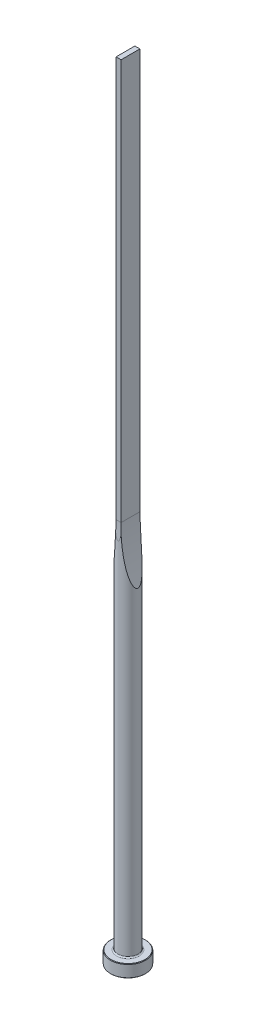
ISO-10303-21;
HEADER;
FILE_DESCRIPTION(('STEP AP214'),'2;1');
FILE_NAME('part.step','',(''),(''),'','','');
FILE_SCHEMA(('AUTOMOTIVE_DESIGN { 1 0 10303 214 1 1 1 1 }'));
ENDSEC;
DATA;
#1=APPLICATION_CONTEXT('core data for automotive mechanical design processes');
#2=APPLICATION_PROTOCOL_DEFINITION('international standard','automotive_design',2000,#1);
#3=PRODUCT_CONTEXT('',#1,'mechanical');
#4=PRODUCT('Part','Part','',(#3));
#5=PRODUCT_RELATED_PRODUCT_CATEGORY('part','',(#4));
#6=PRODUCT_DEFINITION_FORMATION('','',#4);
#7=PRODUCT_DEFINITION_CONTEXT('part definition',#1,'design');
#8=PRODUCT_DEFINITION('design','',#6,#7);
#9=PRODUCT_DEFINITION_SHAPE('','',#8);
#10=(LENGTH_UNIT() NAMED_UNIT(*) SI_UNIT(.MILLI.,.METRE.));
#11=(NAMED_UNIT(*) PLANE_ANGLE_UNIT() SI_UNIT($,.RADIAN.));
#12=(NAMED_UNIT(*) SI_UNIT($,.STERADIAN.) SOLID_ANGLE_UNIT());
#13=UNCERTAINTY_MEASURE_WITH_UNIT(LENGTH_MEASURE(1.E-05),#10,'distance_accuracy_value','');
#14=(GEOMETRIC_REPRESENTATION_CONTEXT(3) GLOBAL_UNCERTAINTY_ASSIGNED_CONTEXT((#13)) GLOBAL_UNIT_ASSIGNED_CONTEXT((#10,
#11,#12)) REPRESENTATION_CONTEXT('',''));
#15=CARTESIAN_POINT('',(0.,0.,0.));
#16=DIRECTION('',(0.,0.,1.));
#17=DIRECTION('',(1.,0.,0.));
#18=AXIS2_PLACEMENT_3D('',#15,#16,#17);
#19=CARTESIAN_POINT('',(0.,0.,0.));
#20=DIRECTION('',(0.,1.,0.));
#21=DIRECTION('',(-1.,0.,0.));
#22=AXIS2_PLACEMENT_3D('',#19,#20,#21);
#23=PLANE('',#22);
#24=CARTESIAN_POINT('',(0.,0.,0.));
#25=DIRECTION('',(0.,1.,0.));
#26=DIRECTION('',(-1.,0.,0.));
#27=AXIS2_PLACEMENT_3D('',#24,#25,#26);
#28=CIRCLE('',#27,6.8);
#29=CARTESIAN_POINT('',(-6.8,0.,0.));
#30=VERTEX_POINT('',#29);
#31=EDGE_CURVE('E133',#30,#30,#28,.T.);
#32=ORIENTED_EDGE('',*,*,#31,.F.);
#33=EDGE_LOOP('',(#32));
#34=FACE_BOUND('',#33,.T.);
#35=ADVANCED_FACE('F32',(#34),#23,.F.);
#36=CARTESIAN_POINT('',(0.,0.,0.));
#37=DIRECTION('',(0.,1.,0.));
#38=DIRECTION('',(-1.,0.,0.));
#39=AXIS2_PLACEMENT_3D('',#36,#37,#38);
#40=CONICAL_SURFACE('',#39,6.8,0.785398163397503);
#41=CARTESIAN_POINT('',(0.,0.199999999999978,0.));
#42=DIRECTION('',(0.,1.,0.));
#43=DIRECTION('',(-1.,0.,0.));
#44=AXIS2_PLACEMENT_3D('',#41,#42,#43);
#45=CIRCLE('',#44,7.);
#46=CARTESIAN_POINT('',(-7.,0.199999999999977,0.));
#47=VERTEX_POINT('',#46);
#48=EDGE_CURVE('E130',#47,#47,#45,.T.);
#49=ORIENTED_EDGE('',*,*,#48,.F.);
#50=EDGE_LOOP('',(#49));
#51=FACE_BOUND('',#50,.T.);
#52=ORIENTED_EDGE('',*,*,#31,.T.);
#53=EDGE_LOOP('',(#52));
#54=FACE_BOUND('',#53,.T.);
#55=ADVANCED_FACE('F171',(#51,#54),#40,.T.);
#56=CARTESIAN_POINT('',(0.,315.,0.));
#57=DIRECTION('',(0.,1.,0.));
#58=DIRECTION('',(-1.,0.,0.));
#59=AXIS2_PLACEMENT_3D('',#56,#57,#58);
#60=CYLINDRICAL_SURFACE('',#59,7.);
#61=CARTESIAN_POINT('',(0.,4.80000000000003,0.));
#62=DIRECTION('',(0.,1.,0.));
#63=DIRECTION('',(-1.,0.,0.));
#64=AXIS2_PLACEMENT_3D('',#61,#62,#63);
#65=CIRCLE('',#64,7.);
#66=CARTESIAN_POINT('',(-7.,4.80000000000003,0.));
#67=VERTEX_POINT('',#66);
#68=EDGE_CURVE('E127',#67,#67,#65,.T.);
#69=ORIENTED_EDGE('',*,*,#68,.F.);
#70=EDGE_LOOP('',(#69));
#71=FACE_BOUND('',#70,.T.);
#72=ORIENTED_EDGE('',*,*,#48,.T.);
#73=EDGE_LOOP('',(#72));
#74=FACE_BOUND('',#73,.T.);
#75=ADVANCED_FACE('F176',(#71,#74),#60,.T.);
#76=CARTESIAN_POINT('',(0.,4.80000000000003,0.));
#77=DIRECTION('',(0.,-1.,0.));
#78=DIRECTION('',(1.,0.,0.));
#79=AXIS2_PLACEMENT_3D('',#76,#77,#78);
#80=CONICAL_SURFACE('',#79,7.,0.785398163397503);
#81=CARTESIAN_POINT('',(0.,5.,0.));
#82=DIRECTION('',(0.,1.,0.));
#83=DIRECTION('',(-1.,0.,0.));
#84=AXIS2_PLACEMENT_3D('',#81,#82,#83);
#85=CIRCLE('',#84,6.8);
#86=CARTESIAN_POINT('',(-6.8,5.,0.));
#87=VERTEX_POINT('',#86);
#88=EDGE_CURVE('E124',#87,#87,#85,.T.);
#89=ORIENTED_EDGE('',*,*,#88,.F.);
#90=EDGE_LOOP('',(#89));
#91=FACE_BOUND('',#90,.T.);
#92=ORIENTED_EDGE('',*,*,#68,.T.);
#93=EDGE_LOOP('',(#92));
#94=FACE_BOUND('',#93,.T.);
#95=ADVANCED_FACE('F183',(#91,#94),#80,.T.);
#96=CARTESIAN_POINT('',(6.8,5.,0.));
#97=DIRECTION('',(0.,-1.,0.));
#98=DIRECTION('',(1.,0.,0.));
#99=AXIS2_PLACEMENT_3D('',#96,#97,#98);
#100=PLANE('',#99);
#101=CARTESIAN_POINT('',(0.,5.,0.));
#102=DIRECTION('',(0.,1.,0.));
#103=DIRECTION('',(-1.,0.,0.));
#104=AXIS2_PLACEMENT_3D('',#101,#102,#103);
#105=CIRCLE('',#104,4.50000000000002);
#106=CARTESIAN_POINT('',(-4.50000000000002,5.,0.));
#107=VERTEX_POINT('',#106);
#108=EDGE_CURVE('E121',#107,#107,#105,.T.);
#109=ORIENTED_EDGE('',*,*,#108,.F.);
#110=EDGE_LOOP('',(#109));
#111=FACE_BOUND('',#110,.T.);
#112=ORIENTED_EDGE('',*,*,#88,.T.);
#113=EDGE_LOOP('',(#112));
#114=FACE_BOUND('',#113,.T.);
#115=ADVANCED_FACE('F190',(#111,#114),#100,.F.);
#116=CARTESIAN_POINT('',(0.,5.5,0.));
#117=DIRECTION('',(0.,1.,0.));
#118=DIRECTION('',(-1.,0.,0.));
#119=AXIS2_PLACEMENT_3D('',#116,#117,#118);
#120=TOROIDAL_SURFACE('',#119,4.50000000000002,0.5);
#121=CARTESIAN_POINT('',(0.,5.50000000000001,0.));
#122=DIRECTION('',(0.,1.,0.));
#123=DIRECTION('',(-1.,0.,0.));
#124=AXIS2_PLACEMENT_3D('',#121,#122,#123);
#125=CIRCLE('',#124,4.00000000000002);
#126=CARTESIAN_POINT('',(-4.00000000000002,5.50000000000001,0.));
#127=VERTEX_POINT('',#126);
#128=EDGE_CURVE('E112',#127,#127,#125,.T.);
#129=ORIENTED_EDGE('',*,*,#128,.F.);
#130=EDGE_LOOP('',(#129));
#131=FACE_BOUND('',#130,.T.);
#132=ORIENTED_EDGE('',*,*,#108,.T.);
#133=EDGE_LOOP('',(#132));
#134=FACE_BOUND('',#133,.T.);
#135=ADVANCED_FACE('F168',(#131,#134),#120,.F.);
#136=CARTESIAN_POINT('',(0.,315.,0.));
#137=DIRECTION('',(0.,1.,0.));
#138=DIRECTION('',(-1.,0.,0.));
#139=AXIS2_PLACEMENT_3D('',#136,#137,#138);
#140=CYLINDRICAL_SURFACE('',#139,4.00000000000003);
#141=CARTESIAN_POINT('',(4.00000000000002,131.956562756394,0.));
#142=CARTESIAN_POINT('',(3.99999908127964,131.956566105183,0.0693234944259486));
#143=CARTESIAN_POINT('',(3.99817235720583,131.96345969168,0.138657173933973));
#144=CARTESIAN_POINT('',(3.99114244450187,131.990026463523,0.274681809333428));
#145=CARTESIAN_POINT('',(3.98593276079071,132.009724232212,0.341367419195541));
#146=CARTESIAN_POINT('',(3.97135064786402,132.064979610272,0.484371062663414));
#147=CARTESIAN_POINT('',(3.96131888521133,132.103056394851,0.559625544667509));
#148=CARTESIAN_POINT('',(3.93842891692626,132.190246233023,0.702905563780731));
#149=CARTESIAN_POINT('',(3.92556515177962,132.239380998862,0.770916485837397));
#150=CARTESIAN_POINT('',(3.89970776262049,132.33854848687,0.891965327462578));
#151=CARTESIAN_POINT('',(3.88693718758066,132.387678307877,0.945808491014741));
#152=CARTESIAN_POINT('',(3.8603742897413,132.490258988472,1.04897593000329));
#153=CARTESIAN_POINT('',(3.84658113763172,132.543713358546,1.09829646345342));
#154=CARTESIAN_POINT('',(3.81825138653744,132.653949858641,1.19306609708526));
#155=CARTESIAN_POINT('',(3.80371318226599,132.710739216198,1.23850622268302));
#156=CARTESIAN_POINT('',(3.77413701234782,132.826763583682,1.3259013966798));
#157=CARTESIAN_POINT('',(3.75909921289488,132.885997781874,1.3678575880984));
#158=CARTESIAN_POINT('',(3.72120715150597,133.035918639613,1.46859658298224));
#159=CARTESIAN_POINT('',(3.69813627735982,133.127783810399,1.5255406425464));
#160=CARTESIAN_POINT('',(3.65154067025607,133.314614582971,1.63392905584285));
#161=CARTESIAN_POINT('',(3.62801571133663,133.409581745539,1.68537058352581));
#162=CARTESIAN_POINT('',(3.58069701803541,133.601979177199,1.78370145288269));
#163=CARTESIAN_POINT('',(3.55690289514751,133.699413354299,1.83058291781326));
#164=CARTESIAN_POINT('',(3.5092307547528,133.896077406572,1.9203843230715));
#165=CARTESIAN_POINT('',(3.48535272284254,133.995307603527,1.96330354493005));
#166=CARTESIAN_POINT('',(3.41352667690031,134.296081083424,2.08735367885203));
#167=CARTESIAN_POINT('',(3.36561636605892,134.499774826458,2.16331575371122));
#168=CARTESIAN_POINT('',(3.29428173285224,134.807968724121,2.26924886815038));
#169=CARTESIAN_POINT('',(3.27060420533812,134.91108776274,2.30320927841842));
#170=CARTESIAN_POINT('',(3.22345187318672,135.118127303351,2.36875344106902));
#171=CARTESIAN_POINT('',(3.19997706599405,135.222047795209,2.40033722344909));
#172=CARTESIAN_POINT('',(3.13222587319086,135.524489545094,2.48887679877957));
#173=CARTESIAN_POINT('',(3.08826162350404,135.723894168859,2.54305671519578));
#174=CARTESIAN_POINT('',(3.00136468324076,136.124560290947,2.6450500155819));
#175=CARTESIAN_POINT('',(2.9584321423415,136.325822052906,2.69286248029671));
#176=CARTESIAN_POINT('',(2.87369595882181,136.729883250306,2.78311065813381));
#177=CARTESIAN_POINT('',(2.83189286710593,136.932683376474,2.825543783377));
#178=CARTESIAN_POINT('',(2.74951474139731,137.339452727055,2.90576401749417));
#179=CARTESIAN_POINT('',(2.70893977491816,137.54342201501,2.94355087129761));
#180=CARTESIAN_POINT('',(2.58896832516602,138.157679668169,3.05104054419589));
#181=CARTESIAN_POINT('',(2.51151492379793,138.569414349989,3.11467696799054));
#182=CARTESIAN_POINT('',(2.36211591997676,139.395458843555,3.22943230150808));
#183=CARTESIAN_POINT('',(2.29016893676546,139.809767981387,3.28055435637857));
#184=CARTESIAN_POINT('',(2.15175693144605,140.641453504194,3.3729631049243));
#185=CARTESIAN_POINT('',(2.0853059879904,141.058834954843,3.41422502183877));
#186=CARTESIAN_POINT('',(1.95819345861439,141.895205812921,3.48868104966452));
#187=CARTESIAN_POINT('',(1.89753217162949,142.314195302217,3.5218747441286));
#188=CARTESIAN_POINT('',(1.78214714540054,143.152903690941,3.58164270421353));
#189=CARTESIAN_POINT('',(1.72741586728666,143.57262095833,3.6082254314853));
#190=CARTESIAN_POINT('',(1.62384822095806,144.413084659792,3.65600398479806));
#191=CARTESIAN_POINT('',(1.57501187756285,144.833831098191,3.67719978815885));
#192=CARTESIAN_POINT('',(1.47580213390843,145.744696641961,3.71824477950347));
#193=CARTESIAN_POINT('',(1.42647153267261,146.234964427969,3.73731372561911));
#194=CARTESIAN_POINT('',(1.33585613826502,147.216415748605,3.77065176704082));
#195=CARTESIAN_POINT('',(1.29457158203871,147.707599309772,3.78492072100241));
#196=CARTESIAN_POINT('',(1.2200681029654,148.690730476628,3.80958961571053));
#197=CARTESIAN_POINT('',(1.18685011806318,149.18267816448,3.81998910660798));
#198=CARTESIAN_POINT('',(1.12850115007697,150.167110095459,3.83763118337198));
#199=CARTESIAN_POINT('',(1.1033702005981,150.659594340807,3.84487375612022));
#200=CARTESIAN_POINT('',(1.06117886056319,151.645564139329,3.85673174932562));
#201=CARTESIAN_POINT('',(1.04412872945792,152.139050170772,3.86134383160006));
#202=CARTESIAN_POINT('',(1.01815247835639,153.126252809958,3.86827428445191));
#203=CARTESIAN_POINT('',(1.00922637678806,153.619969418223,3.87059264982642));
#204=CARTESIAN_POINT('',(0.999501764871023,154.607446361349,3.87311520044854));
#205=CARTESIAN_POINT('',(0.998702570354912,155.101206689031,3.87331956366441));
#206=CARTESIAN_POINT('',(1.0052303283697,156.088679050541,3.87163059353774));
#207=CARTESIAN_POINT('',(1.01255742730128,156.582391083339,3.86973722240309));
#208=CARTESIAN_POINT('',(1.03528419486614,157.567392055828,3.86371897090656));
#209=CARTESIAN_POINT('',(1.05064737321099,158.058681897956,3.85960417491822));
#210=CARTESIAN_POINT('',(1.08941871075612,159.040907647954,3.8488403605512));
#211=CARTESIAN_POINT('',(1.11282671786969,159.53184356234,3.84219139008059));
#212=CARTESIAN_POINT('',(1.16768273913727,160.513290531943,3.82587724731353));
#213=CARTESIAN_POINT('',(1.1991319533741,161.003801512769,3.81621162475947));
#214=CARTESIAN_POINT('',(1.2700546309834,161.984155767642,3.79319818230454));
#215=CARTESIAN_POINT('',(1.30952805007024,162.473999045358,3.77985038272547));
#216=CARTESIAN_POINT('',(1.39641875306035,163.452158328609,3.74861904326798));
#217=CARTESIAN_POINT('',(1.44382502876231,163.940475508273,3.73074177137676));
#218=CARTESIAN_POINT('',(1.54658814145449,164.916030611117,3.68932757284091));
#219=CARTESIAN_POINT('',(1.60194486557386,165.403268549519,3.66579072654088));
#220=CARTESIAN_POINT('',(1.72054689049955,166.376264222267,3.61164347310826));
#221=CARTESIAN_POINT('',(1.78379011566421,166.862022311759,3.58103492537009));
#222=CARTESIAN_POINT('',(1.91810188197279,167.831796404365,3.51093205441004));
#223=CARTESIAN_POINT('',(1.98916982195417,168.315812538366,3.47143841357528));
#224=CARTESIAN_POINT('',(2.10122535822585,169.038039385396,3.40392660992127));
#225=CARTESIAN_POINT('',(2.13930667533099,169.277104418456,3.38016662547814));
#226=CARTESIAN_POINT('',(2.21734164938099,169.754595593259,3.32949919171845));
#227=CARTESIAN_POINT('',(2.25729529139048,169.993021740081,3.30259176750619));
#228=CARTESIAN_POINT('',(2.3390661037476,170.469233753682,3.24519121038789));
#229=CARTESIAN_POINT('',(2.38088409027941,170.707019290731,3.21469649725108));
#230=CARTESIAN_POINT('',(2.46633098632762,171.181705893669,3.14961854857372));
#231=CARTESIAN_POINT('',(2.50995988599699,171.418606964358,3.11503533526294));
#232=CARTESIAN_POINT('',(2.59920106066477,171.892518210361,3.04097591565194));
#233=CARTESIAN_POINT('',(2.6448220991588,172.129523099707,3.00147629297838));
#234=CARTESIAN_POINT('',(2.73777477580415,172.602204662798,2.91693995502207));
#235=CARTESIAN_POINT('',(2.78510635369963,172.837881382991,2.8719034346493));
#236=CARTESIAN_POINT('',(2.88134423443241,173.307372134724,2.77533816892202));
#237=CARTESIAN_POINT('',(2.93024917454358,173.54118757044,2.72381493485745));
#238=CARTESIAN_POINT('',(3.02952417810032,174.006629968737,2.61295390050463));
#239=CARTESIAN_POINT('',(3.07989403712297,174.238257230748,2.55361718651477));
#240=CARTESIAN_POINT('',(3.18241500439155,174.700977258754,2.42468436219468));
#241=CARTESIAN_POINT('',(3.23457918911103,174.932039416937,2.35498797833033));
#242=CARTESIAN_POINT('',(3.33990650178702,175.390273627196,2.20309693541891));
#243=CARTESIAN_POINT('',(3.39307093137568,175.617439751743,2.12088483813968));
#244=CARTESIAN_POINT('',(3.47273982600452,175.952130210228,1.98563598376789));
#245=CARTESIAN_POINT('',(3.49916049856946,176.062186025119,1.9388095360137));
#246=CARTESIAN_POINT('',(3.55191505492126,176.280154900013,1.84038793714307));
#247=CARTESIAN_POINT('',(3.57824895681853,176.388068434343,1.78879385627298));
#248=CARTESIAN_POINT('',(3.63057497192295,176.60082277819,1.68004710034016));
#249=CARTESIAN_POINT('',(3.65656774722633,176.705670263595,1.62290788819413));
#250=CARTESIAN_POINT('',(3.70796358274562,176.911448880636,1.50178061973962));
#251=CARTESIAN_POINT('',(3.733367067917,177.012382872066,1.43779769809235));
#252=CARTESIAN_POINT('',(3.76958048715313,177.155271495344,1.33841469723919));
#253=CARTESIAN_POINT('',(3.78081713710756,177.199462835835,1.30638269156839));
#254=CARTESIAN_POINT('',(3.80299560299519,177.286418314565,1.24033761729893));
#255=CARTESIAN_POINT('',(3.81393737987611,177.32918226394,1.20632428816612));
#256=CARTESIAN_POINT('',(3.84622039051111,177.454980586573,1.10091663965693));
#257=CARTESIAN_POINT('',(3.86700644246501,177.535470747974,1.0261889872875));
#258=CARTESIAN_POINT('',(3.90290257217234,177.673771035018,0.878722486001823));
#259=CARTESIAN_POINT('',(3.91838915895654,177.733150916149,0.807567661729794));
#260=CARTESIAN_POINT('',(3.94649013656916,177.840522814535,0.656561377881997));
#261=CARTESIAN_POINT('',(3.95911214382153,177.888545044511,0.57673383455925));
#262=CARTESIAN_POINT('',(3.97654860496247,177.954731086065,0.436218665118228));
#263=CARTESIAN_POINT('',(3.98256540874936,177.97751993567,0.377882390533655));
#264=CARTESIAN_POINT('',(3.99211051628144,178.013637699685,0.258155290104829));
#265=CARTESIAN_POINT('',(3.99564216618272,178.026979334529,0.196768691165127));
#266=CARTESIAN_POINT('',(3.99983907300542,178.042831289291,0.0720803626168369));
#267=CARTESIAN_POINT('',(4.00048616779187,178.045272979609,0.00876901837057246));
#268=CARTESIAN_POINT('',(3.99877838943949,178.038824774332,-0.117242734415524));
#269=CARTESIAN_POINT('',(3.99642227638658,178.02993019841,-0.179942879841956));
#270=CARTESIAN_POINT('',(3.98928141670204,178.002935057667,-0.298132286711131));
#271=CARTESIAN_POINT('',(3.98469267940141,177.985577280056,-0.353809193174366));
#272=CARTESIAN_POINT('',(3.97359466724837,177.943523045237,-0.46207223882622));
#273=CARTESIAN_POINT('',(3.96708467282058,177.918823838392,-0.51465721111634));
#274=CARTESIAN_POINT('',(3.9472182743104,177.843283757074,-0.653780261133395));
#275=CARTESIAN_POINT('',(3.93234499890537,177.78656583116,-0.736891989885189));
#276=CARTESIAN_POINT('',(3.89976659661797,177.661719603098,-0.89345405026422));
#277=CARTESIAN_POINT('',(3.88205151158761,177.593551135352,-0.966868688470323));
#278=CARTESIAN_POINT('',(3.84515803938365,177.450810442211,-1.10441932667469));
#279=CARTESIAN_POINT('',(3.82600386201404,177.376342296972,-1.16867176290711));
#280=CARTESIAN_POINT('',(3.78663004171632,177.222385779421,-1.29055678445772));
#281=CARTESIAN_POINT('',(3.76640931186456,177.142892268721,-1.34818241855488));
#282=CARTESIAN_POINT('',(3.72527346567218,176.980199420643,-1.45800523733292));
#283=CARTESIAN_POINT('',(3.70435700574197,176.896992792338,-1.51019100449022));
#284=CARTESIAN_POINT('',(3.66213788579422,176.727987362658,-1.60986556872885));
#285=CARTESIAN_POINT('',(3.64083541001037,176.642189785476,-1.65735654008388));
#286=CARTESIAN_POINT('',(3.58333461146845,176.409093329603,-1.77958680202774));
#287=CARTESIAN_POINT('',(3.54693304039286,176.259943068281,-1.85069466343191));
#288=CARTESIAN_POINT('',(3.47402617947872,175.957769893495,-1.98416277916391));
#289=CARTESIAN_POINT('',(3.43752084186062,175.804744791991,-2.04651795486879));
#290=CARTESIAN_POINT('',(3.36465781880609,175.495659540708,-2.16422609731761));
#291=CARTESIAN_POINT('',(3.32830054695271,175.339594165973,-2.21956550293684));
#292=CARTESIAN_POINT('',(3.25599936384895,175.025392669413,-2.32433091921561));
#293=CARTESIAN_POINT('',(3.2200555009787,174.867256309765,-2.37375624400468));
#294=CARTESIAN_POINT('',(3.14853498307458,174.548577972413,-2.46784011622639));
#295=CARTESIAN_POINT('',(3.1129611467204,174.388027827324,-2.51247298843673));
#296=CARTESIAN_POINT('',(3.04246152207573,174.065640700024,-2.59739704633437));
#297=CARTESIAN_POINT('',(3.00753576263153,173.903803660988,-2.637688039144));
#298=CARTESIAN_POINT('',(2.93844678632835,173.579298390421,-2.71444158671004));
#299=CARTESIAN_POINT('',(2.90428263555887,173.416631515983,-2.75090905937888));
#300=CARTESIAN_POINT('',(2.83672091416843,173.090438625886,-2.8205250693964));
#301=CARTESIAN_POINT('',(2.80332332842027,172.92691262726,-2.85367367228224));
#302=CARTESIAN_POINT('',(2.70147864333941,172.421043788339,-2.95146748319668));
#303=CARTESIAN_POINT('',(2.6343793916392,172.077474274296,-3.01119821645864));
#304=CARTESIAN_POINT('',(2.50391772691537,171.388001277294,-3.12051465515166));
#305=CARTESIAN_POINT('',(2.44055587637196,171.042097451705,-3.17009883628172));
#306=CARTESIAN_POINT('',(2.31768945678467,170.348353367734,-3.26100537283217));
#307=CARTESIAN_POINT('',(2.25818681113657,170.000512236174,-3.30232362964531));
#308=CARTESIAN_POINT('',(2.14316659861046,169.303424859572,-3.37810211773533));
#309=CARTESIAN_POINT('',(2.08764916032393,168.954178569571,-3.41256212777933));
#310=CARTESIAN_POINT('',(1.98054110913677,168.253744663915,-3.47582142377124));
#311=CARTESIAN_POINT('',(1.92895986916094,167.902554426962,-3.50460744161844));
#312=CARTESIAN_POINT('',(1.82991060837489,167.199233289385,-3.5573252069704));
#313=CARTESIAN_POINT('',(1.78244263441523,166.847102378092,-3.58125689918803));
#314=CARTESIAN_POINT('',(1.64628374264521,165.789733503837,-3.64691345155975));
#315=CARTESIAN_POINT('',(1.56380501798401,165.083304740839,-3.68251817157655));
#316=CARTESIAN_POINT('',(1.41559952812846,163.668399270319,-3.74197834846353));
#317=CARTESIAN_POINT('',(1.34986900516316,162.959923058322,-3.76583644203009));
#318=CARTESIAN_POINT('',(1.23521097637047,161.541334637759,-3.80498659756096));
#319=CARTESIAN_POINT('',(1.18628456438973,160.83122232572,-3.82027810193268));
#320=CARTESIAN_POINT('',(1.10533658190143,159.410777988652,-3.84447711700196));
#321=CARTESIAN_POINT('',(1.07329506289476,158.700447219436,-3.85339216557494));
#322=CARTESIAN_POINT('',(1.02605523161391,157.279204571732,-3.86624049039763));
#323=CARTESIAN_POINT('',(1.01085628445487,156.568292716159,-3.87017395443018));
#324=CARTESIAN_POINT('',(0.999328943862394,155.358226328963,-3.87315713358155));
#325=CARTESIAN_POINT('',(0.998726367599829,154.859110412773,-3.87331302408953));
#326=CARTESIAN_POINT('',(1.00582442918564,153.860941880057,-3.87147723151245));
#327=CARTESIAN_POINT('',(1.01352501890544,153.36188926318,-3.86948556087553));
#328=CARTESIAN_POINT('',(1.03722967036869,152.36387254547,-3.86319865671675));
#329=CARTESIAN_POINT('',(1.05323578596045,151.864908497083,-3.85890285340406));
#330=CARTESIAN_POINT('',(1.09354668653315,150.867344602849,-3.8476738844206));
#331=CARTESIAN_POINT('',(1.11785146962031,150.368744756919,-3.84074071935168));
#332=CARTESIAN_POINT('',(1.17470614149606,149.372836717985,-3.82373444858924));
#333=CARTESIAN_POINT('',(1.20724330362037,148.875527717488,-3.81366618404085));
#334=CARTESIAN_POINT('',(1.28056586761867,147.881612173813,-3.78967555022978));
#335=CARTESIAN_POINT('',(1.32135121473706,147.385005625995,-3.77575320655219));
#336=CARTESIAN_POINT('',(1.41113931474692,146.392785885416,-3.74312274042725));
#337=CARTESIAN_POINT('',(1.46014051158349,145.897172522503,-3.72441552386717));
#338=CARTESIAN_POINT('',(1.56633082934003,144.907097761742,-3.68101972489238));
#339=CARTESIAN_POINT('',(1.623519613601,144.412636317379,-3.6563313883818));
#340=CARTESIAN_POINT('',(1.72671298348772,143.580882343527,-3.6084056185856));
#341=CARTESIAN_POINT('',(1.77055626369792,143.243205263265,-3.58716639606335));
#342=CARTESIAN_POINT('',(1.86203181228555,142.568649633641,-3.54054739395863));
#343=CARTESIAN_POINT('',(1.90966405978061,142.23177107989,-3.51516763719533));
#344=CARTESIAN_POINT('',(2.00868306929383,141.558976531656,-3.45954065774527));
#345=CARTESIAN_POINT('',(2.06006968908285,141.223060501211,-3.42929361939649));
#346=CARTESIAN_POINT('',(2.16654882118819,140.552396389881,-3.36303263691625));
#347=CARTESIAN_POINT('',(2.22164124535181,140.217648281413,-3.32701882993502));
#348=CARTESIAN_POINT('',(2.3567009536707,139.424959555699,-3.23342990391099));
#349=CARTESIAN_POINT('',(2.43828227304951,138.967636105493,-3.17282276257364));
#350=CARTESIAN_POINT('',(2.5655946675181,138.284448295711,-3.06931357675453));
#351=CARTESIAN_POINT('',(2.60885994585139,138.057163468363,-3.03270663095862));
#352=CARTESIAN_POINT('',(2.6969784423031,137.603744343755,-2.95461990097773));
#353=CARTESIAN_POINT('',(2.74183160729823,137.377610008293,-2.91314027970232));
#354=CARTESIAN_POINT('',(2.85075538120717,136.839257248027,-2.8073136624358));
#355=CARTESIAN_POINT('',(2.91552855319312,136.527689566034,-2.74033948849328));
#356=CARTESIAN_POINT('',(3.04764143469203,135.908571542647,-2.59263375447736));
#357=CARTESIAN_POINT('',(3.11497908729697,135.601018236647,-2.51191304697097));
#358=CARTESIAN_POINT('',(3.23134949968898,135.082365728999,-2.35894677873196));
#359=CARTESIAN_POINT('',(3.27986780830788,134.869793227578,-2.29132479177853));
#360=CARTESIAN_POINT('',(3.37766837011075,134.448265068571,-2.14457559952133));
#361=CARTESIAN_POINT('',(3.42695189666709,134.239317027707,-2.06542683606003));
#362=CARTESIAN_POINT('',(3.50323968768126,133.920854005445,-1.93138787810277));
#363=CARTESIAN_POINT('',(3.5302327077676,133.809135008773,-1.88173006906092));
#364=CARTESIAN_POINT('',(3.58405466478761,133.588194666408,-1.7770832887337));
#365=CARTESIAN_POINT('',(3.61088364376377,133.478972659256,-1.72209575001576));
#366=CARTESIAN_POINT('',(3.66405248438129,133.264212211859,-1.60586223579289));
#367=CARTESIAN_POINT('',(3.69039359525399,133.15866348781,-1.54463600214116));
#368=CARTESIAN_POINT('',(3.74226306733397,132.952355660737,-1.41435283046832));
#369=CARTESIAN_POINT('',(3.76779216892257,132.851592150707,-1.34530330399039));
#370=CARTESIAN_POINT('',(3.81202336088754,132.67819629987,-1.21334596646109));
#371=CARTESIAN_POINT('',(3.83100666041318,132.604197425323,-1.15234628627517));
#372=CARTESIAN_POINT('',(3.86759286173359,132.462276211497,-1.02286989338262));
#373=CARTESIAN_POINT('',(3.88519303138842,132.394365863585,-0.954378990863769));
#374=CARTESIAN_POINT('',(3.91836097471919,132.266928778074,-0.807593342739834));
#375=CARTESIAN_POINT('',(3.93389645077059,132.207534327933,-0.729173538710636));
#376=CARTESIAN_POINT('',(3.96115450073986,132.103662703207,-0.562403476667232));
#377=CARTESIAN_POINT('',(3.97289362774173,132.059120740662,-0.474098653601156));
#378=CARTESIAN_POINT('',(3.98760341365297,132.003405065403,-0.320570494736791));
#379=CARTESIAN_POINT('',(3.99219982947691,131.986029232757,-0.257781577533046));
#380=CARTESIAN_POINT('',(3.99839643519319,131.962614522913,-0.129995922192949));
#381=CARTESIAN_POINT('',(4.00000086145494,131.956559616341,-0.0650024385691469));
#382=CARTESIAN_POINT('',(4.00000000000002,131.956562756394,0.));
#383=B_SPLINE_CURVE_WITH_KNOTS('',3,(#141,#142,#143,#144,#145,#146,#147,#148,#149,#150,#151,
#152,#153,#154,#155,#156,#157,#158,#159,#160,#161,#162,#163,#164,#165,#166,#167,#168,#169,#170,
#171,#172,#173,#174,#175,#176,#177,#178,#179,#180,#181,#182,#183,#184,#185,#186,#187,#188,#189,
#190,#191,#192,#193,#194,#195,#196,#197,#198,#199,#200,#201,#202,#203,#204,#205,#206,#207,#208,
#209,#210,#211,#212,#213,#214,#215,#216,#217,#218,#219,#220,#221,#222,#223,#224,#225,#226,#227,
#228,#229,#230,#231,#232,#233,#234,#235,#236,#237,#238,#239,#240,#241,#242,#243,#244,#245,#246,
#247,#248,#249,#250,#251,#252,#253,#254,#255,#256,#257,#258,#259,#260,#261,#262,#263,#264,#265,
#266,#267,#268,#269,#270,#271,#272,#273,#274,#275,#276,#277,#278,#279,#280,#281,#282,#283,#284,
#285,#286,#287,#288,#289,#290,#291,#292,#293,#294,#295,#296,#297,#298,#299,#300,#301,#302,#303,
#304,#305,#306,#307,#308,#309,#310,#311,#312,#313,#314,#315,#316,#317,#318,#319,#320,#321,#322,
#323,#324,#325,#326,#327,#328,#329,#330,#331,#332,#333,#334,#335,#336,#337,#338,#339,#340,#341,
#342,#343,#344,#345,#346,#347,#348,#349,#350,#351,#352,#353,#354,#355,#356,#357,#358,#359,#360,
#361,#362,#363,#364,#365,#366,#367,#368,#369,#370,#371,#372,#373,#374,#375,#376,#377,#378,#379,
#380,#381,#382),.UNSPECIFIED.,.T.,.F.,(4,2,2,2,2,2,2,2,2,2,2,2,2,2,2,2,2,2,2,2,2,2,2,2,2,2,2,2,
2,2,2,2,2,2,2,2,2,2,2,2,2,2,2,2,2,2,2,2,2,2,2,2,2,2,2,2,2,2,2,2,2,2,2,2,2,2,2,2,2,2,2,2,2,2,2,2,
2,2,2,2,2,2,2,2,2,2,2,2,2,2,2,2,2,2,2,2,2,2,2,2,2,2,2,2,2,2,2,2,2,2,2,2,2,2,2,2,2,2,2,2,4),(0.,
0.207654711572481,0.415709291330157,0.669058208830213,0.922908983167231,1.14458973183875,
1.36645227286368,1.58881477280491,1.81110402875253,2.14240740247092,2.47388012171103,
2.80591559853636,3.13801116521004,3.80539132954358,4.13873386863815,4.4720721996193,
5.10570938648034,5.73943795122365,6.37347024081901,7.00753732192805,8.27850002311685,
9.54914297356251,10.8229460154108,12.0968147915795,13.3690446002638,14.641279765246,
16.120517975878,17.599799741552,19.0792534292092,20.5587132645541,22.0400464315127,
23.521382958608,25.0025947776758,26.483833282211,27.9584034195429,29.4329456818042,
30.9077081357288,32.3824624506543,33.8551870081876,35.3278906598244,36.8002075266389,
38.2724113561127,39.0021153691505,39.731813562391,40.4618344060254,41.1918512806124,
41.9254887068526,42.6591003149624,43.3920927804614,44.1249834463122,44.8654956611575,
45.6070492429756,45.9744252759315,46.3417190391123,46.7081423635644,47.0742926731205,
47.2414153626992,47.4085600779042,47.7430365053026,48.0241616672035,48.3045303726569,
48.4925925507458,48.6804010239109,48.8693903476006,49.0584577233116,49.2333036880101,
49.4082152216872,49.7115824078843,50.0160368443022,50.3161898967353,50.6166549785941,
50.9177385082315,51.2186819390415,51.7258716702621,52.2333544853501,52.7418037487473,
53.25031192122,53.7614211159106,54.2725530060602,54.783019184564,55.2934752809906,
56.3585947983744,57.4238742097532,58.4896805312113,59.555521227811,60.6238254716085,
61.6921418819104,63.8281212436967,65.963620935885,68.0992596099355,70.2323694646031,
72.3653989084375,73.8626801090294,75.3599526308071,76.857595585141,78.3552381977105,
79.8505795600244,81.3459109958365,82.8409595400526,84.3359466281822,85.3594253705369,
86.3828984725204,87.4063328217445,88.4297428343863,89.8348427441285,90.5375282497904,
91.2401902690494,92.2155496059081,93.1901424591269,93.8747780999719,94.5607110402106,
94.9362132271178,95.3116147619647,95.6858632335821,96.0597600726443,96.3526877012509,
96.6461801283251,96.9438272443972,97.2401584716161,97.4351459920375,97.6298572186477),.UNSPECIFIED.);
#384=CARTESIAN_POINT('',(1.09671499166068,150.828747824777,-3.84671499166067));
#385=VERTEX_POINT('',#384);
#386=CARTESIAN_POINT('',(1.09671499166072,150.828747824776,3.84671499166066));
#387=VERTEX_POINT('',#386);
#388=EDGE_CURVE('E138',#385,#387,#383,.T.);
#389=ORIENTED_EDGE('',*,*,#388,.T.);
#390=CARTESIAN_POINT('',(-1.39194109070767,155.,3.74999999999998));
#391=CARTESIAN_POINT('',(-1.39194449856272,155.334099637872,3.75000007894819));
#392=CARTESIAN_POINT('',(-1.38695792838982,155.668209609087,3.75186098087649));
#393=CARTESIAN_POINT('',(-1.36667392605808,156.336077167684,3.75929815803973));
#394=CARTESIAN_POINT('',(-1.35137656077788,156.669834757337,3.76487440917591));
#395=CARTESIAN_POINT('',(-1.30923320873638,157.337406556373,3.77973662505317));
#396=CARTESIAN_POINT('',(-1.28235776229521,157.671218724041,3.78903204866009));
#397=CARTESIAN_POINT('',(-1.21470251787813,158.337193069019,3.81127649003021));
#398=CARTESIAN_POINT('',(-1.17393087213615,158.669356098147,3.82422336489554));
#399=CARTESIAN_POINT('',(-1.09844611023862,159.165763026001,3.8463071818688));
#400=CARTESIAN_POINT('',(-1.07085040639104,159.331144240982,3.85412453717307));
#401=CARTESIAN_POINT('',(-1.00961852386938,159.660899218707,3.87061811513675));
#402=CARTESIAN_POINT('',(-0.975977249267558,159.825272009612,3.87929505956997));
#403=CARTESIAN_POINT('',(-0.900897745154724,160.151793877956,3.89742276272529));
#404=CARTESIAN_POINT('',(-0.85948063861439,160.313947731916,3.90687138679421));
#405=CARTESIAN_POINT('',(-0.788768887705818,160.554515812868,3.92153114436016));
#406=CARTESIAN_POINT('',(-0.763786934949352,160.634208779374,3.9264953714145));
#407=CARTESIAN_POINT('',(-0.710141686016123,160.792326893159,3.93655330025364));
#408=CARTESIAN_POINT('',(-0.681479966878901,160.870752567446,3.94164694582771));
#409=CARTESIAN_POINT('',(-0.619110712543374,161.025914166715,3.9519241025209));
#410=CARTESIAN_POINT('',(-0.585384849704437,161.102642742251,3.95710787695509));
#411=CARTESIAN_POINT('',(-0.510918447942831,161.252489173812,3.96741853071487));
#412=CARTESIAN_POINT('',(-0.4702059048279,161.32561999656,3.97254555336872));
#413=CARTESIAN_POINT('',(-0.405871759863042,161.421768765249,3.97939443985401));
#414=CARTESIAN_POINT('',(-0.387100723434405,161.447990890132,3.98127456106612));
#415=CARTESIAN_POINT('',(-0.347340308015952,161.498838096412,3.98494137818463));
#416=CARTESIAN_POINT('',(-0.32634572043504,161.523459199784,3.98672783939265));
#417=CARTESIAN_POINT('',(-0.281381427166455,161.570454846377,3.99015550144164));
#418=CARTESIAN_POINT('',(-0.257378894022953,161.592798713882,3.99179469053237));
#419=CARTESIAN_POINT('',(-0.2060020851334,161.633234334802,3.99477391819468));
#420=CARTESIAN_POINT('',(-0.178643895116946,161.651345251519,3.99611530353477));
#421=CARTESIAN_POINT('',(-0.133196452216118,161.674230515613,3.99781497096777));
#422=CARTESIAN_POINT('',(-0.11631594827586,161.681368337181,3.99834625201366));
#423=CARTESIAN_POINT('',(-0.081631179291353,161.692886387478,3.99920443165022));
#424=CARTESIAN_POINT('',(-0.0638281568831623,161.69727022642,3.99953159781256));
#425=CARTESIAN_POINT('',(-0.0275781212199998,161.702824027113,3.99994619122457));
#426=CARTESIAN_POINT('',(-0.00912739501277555,161.703970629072,4.00003187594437));
#427=CARTESIAN_POINT('',(0.0276703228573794,161.702829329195,3.99994663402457));
#428=CARTESIAN_POINT('',(0.0460172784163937,161.700540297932,3.99977562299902));
#429=CARTESIAN_POINT('',(0.0805943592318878,161.693127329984,3.99922251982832));
#430=CARTESIAN_POINT('',(0.0968774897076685,161.68824048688,3.99885808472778));
#431=CARTESIAN_POINT('',(0.12858131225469,161.676235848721,3.99796430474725));
#432=CARTESIAN_POINT('',(0.144001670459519,161.669117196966,3.99743489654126));
#433=CARTESIAN_POINT('',(0.185006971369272,161.647151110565,3.99580470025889));
#434=CARTESIAN_POINT('',(0.209611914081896,161.630495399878,3.99457196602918));
#435=CARTESIAN_POINT('',(0.256071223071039,161.593720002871,3.99186273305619));
#436=CARTESIAN_POINT('',(0.277915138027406,161.573587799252,3.99038535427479));
#437=CARTESIAN_POINT('',(0.35066512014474,161.499085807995,3.98494736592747));
#438=CARTESIAN_POINT('',(0.395552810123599,161.438989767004,3.98061079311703));
#439=CARTESIAN_POINT('',(0.476792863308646,161.313343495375,3.97168524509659));
#440=CARTESIAN_POINT('',(0.51309002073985,161.247761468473,3.96709485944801));
#441=CARTESIAN_POINT('',(0.605299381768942,161.063175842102,3.95438947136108));
#442=CARTESIAN_POINT('',(0.655314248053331,160.9412436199,3.94623160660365));
#443=CARTESIAN_POINT('',(0.745376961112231,160.693666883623,3.93019294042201));
#444=CARTESIAN_POINT('',(0.785397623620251,160.56801326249,3.92231294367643));
#445=CARTESIAN_POINT('',(0.858576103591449,160.314360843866,3.90694950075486));
#446=CARTESIAN_POINT('',(0.89171673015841,160.186357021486,3.89946708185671));
#447=CARTESIAN_POINT('',(0.952763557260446,159.929294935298,3.88499773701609));
#448=CARTESIAN_POINT('',(0.980676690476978,159.800238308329,3.87801016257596));
#449=CARTESIAN_POINT('',(1.05809609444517,159.41306704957,3.85789047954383));
#450=CARTESIAN_POINT('',(1.10161068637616,159.153715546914,3.84552636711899));
#451=CARTESIAN_POINT('',(1.1773991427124,158.63324865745,3.82298810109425));
#452=CARTESIAN_POINT('',(1.20966805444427,158.372132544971,3.81281491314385));
#453=CARTESIAN_POINT('',(1.26533785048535,157.848421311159,3.79470411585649));
#454=CARTESIAN_POINT('',(1.2887229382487,157.585824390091,3.78677049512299));
#455=CARTESIAN_POINT('',(1.32794213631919,157.059995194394,3.77319404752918));
#456=CARTESIAN_POINT('',(1.34377550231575,156.796762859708,3.76755144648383));
#457=CARTESIAN_POINT('',(1.36866096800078,156.270393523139,3.75858225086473));
#458=CARTESIAN_POINT('',(1.37772460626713,156.00725712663,3.75525171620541));
#459=CARTESIAN_POINT('',(1.38952938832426,155.480822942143,3.75089945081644));
#460=CARTESIAN_POINT('',(1.39227046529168,155.217525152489,3.74987774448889));
#461=CARTESIAN_POINT('',(1.39154941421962,154.691232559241,3.75014538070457));
#462=CARTESIAN_POINT('',(1.38809419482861,154.428237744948,3.75143214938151));
#463=CARTESIAN_POINT('',(1.37484398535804,153.902437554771,3.75630869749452));
#464=CARTESIAN_POINT('',(1.36504925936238,153.639632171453,3.75989838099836));
#465=CARTESIAN_POINT('',(1.33880225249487,153.117044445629,3.7693238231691));
#466=CARTESIAN_POINT('',(1.32241801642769,152.857258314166,3.77513659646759));
#467=CARTESIAN_POINT('',(1.28217391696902,152.338202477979,3.78899593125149));
#468=CARTESIAN_POINT('',(1.25831091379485,152.078933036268,3.79704343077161));
#469=CARTESIAN_POINT('',(1.20163024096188,151.560824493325,3.81536023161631));
#470=CARTESIAN_POINT('',(1.1687916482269,151.301987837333,3.82563471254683));
#471=CARTESIAN_POINT('',(1.09180587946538,150.786236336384,3.84832767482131));
#472=CARTESIAN_POINT('',(1.04766828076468,150.529320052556,3.86074433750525));
#473=CARTESIAN_POINT('',(0.969147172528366,150.145796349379,3.88091053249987));
#474=CARTESIAN_POINT('',(0.940826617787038,150.017916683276,3.8879107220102));
#475=CARTESIAN_POINT('',(0.878848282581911,149.763280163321,3.90238986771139));
#476=CARTESIAN_POINT('',(0.845183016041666,149.636525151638,3.90986948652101));
#477=CARTESIAN_POINT('',(0.770839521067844,149.385481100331,3.92521002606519));
#478=CARTESIAN_POINT('',(0.73018499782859,149.261185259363,3.93306959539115));
#479=CARTESIAN_POINT('',(0.66125040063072,149.0778844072,3.94503185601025));
#480=CARTESIAN_POINT('',(0.6369779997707,149.017373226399,3.94904355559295));
#481=CARTESIAN_POINT('',(0.584962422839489,148.897876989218,3.95708454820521));
#482=CARTESIAN_POINT('',(0.557221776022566,148.838890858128,3.96111382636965));
#483=CARTESIAN_POINT('',(0.496796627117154,148.722903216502,3.96914753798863));
#484=CARTESIAN_POINT('',(0.464075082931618,148.665920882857,3.97315152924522));
#485=CARTESIAN_POINT('',(0.391808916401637,148.556588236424,3.98093309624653));
#486=CARTESIAN_POINT('',(0.352311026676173,148.504209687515,3.98471199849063));
#487=CARTESIAN_POINT('',(0.291384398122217,148.439838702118,3.98940404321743));
#488=CARTESIAN_POINT('',(0.274626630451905,148.423500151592,3.9905999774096));
#489=CARTESIAN_POINT('',(0.239433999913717,148.392634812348,3.99286679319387));
#490=CARTESIAN_POINT('',(0.220996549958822,148.378110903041,3.99393747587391));
#491=CARTESIAN_POINT('',(0.182038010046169,148.351512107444,3.99590377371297));
#492=CARTESIAN_POINT('',(0.161493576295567,148.339470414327,3.99679701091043));
#493=CARTESIAN_POINT('',(0.118575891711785,148.319260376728,3.99829905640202));
#494=CARTESIAN_POINT('',(0.0962092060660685,148.311078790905,3.99890883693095));
#495=CARTESIAN_POINT('',(0.0565412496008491,148.301340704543,3.99963520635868));
#496=CARTESIAN_POINT('',(0.0395386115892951,148.298580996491,3.99984131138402));
#497=CARTESIAN_POINT('',(0.00530985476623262,148.296014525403,4.00003297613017));
#498=CARTESIAN_POINT('',(-0.0119161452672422,148.296206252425,4.00001864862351));
#499=CARTESIAN_POINT('',(-0.0460423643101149,148.299517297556,3.99977139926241));
#500=CARTESIAN_POINT('',(-0.062943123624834,148.302631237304,3.99953887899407));
#501=CARTESIAN_POINT('',(-0.0960472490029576,148.311451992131,3.99888109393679));
#502=CARTESIAN_POINT('',(-0.1122498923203,148.317161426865,3.99845563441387));
#503=CARTESIAN_POINT('',(-0.151566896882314,148.334081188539,3.99719710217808));
#504=CARTESIAN_POINT('',(-0.174103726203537,148.346614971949,3.99626655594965));
#505=CARTESIAN_POINT('',(-0.216979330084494,148.374976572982,3.99416860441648));
#506=CARTESIAN_POINT('',(-0.237311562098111,148.390813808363,3.99300052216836));
#507=CARTESIAN_POINT('',(-0.293164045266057,148.439682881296,3.98941150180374));
#508=CARTESIAN_POINT('',(-0.326182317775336,148.475518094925,3.98679738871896));
#509=CARTESIAN_POINT('',(-0.387204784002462,148.551152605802,3.9813315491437));
#510=CARTESIAN_POINT('',(-0.415192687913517,148.590964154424,3.97847909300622));
#511=CARTESIAN_POINT('',(-0.48540204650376,148.700793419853,3.97068874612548));
#512=CARTESIAN_POINT('',(-0.524314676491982,148.772896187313,3.96565520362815));
#513=CARTESIAN_POINT('',(-0.595699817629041,148.920269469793,3.95555476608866));
#514=CARTESIAN_POINT('',(-0.628155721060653,148.995547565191,3.95048781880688));
#515=CARTESIAN_POINT('',(-0.688605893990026,149.148337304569,3.94040179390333));
#516=CARTESIAN_POINT('',(-0.716575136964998,149.225858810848,3.93538312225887));
#517=CARTESIAN_POINT('',(-0.768950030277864,149.381970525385,3.92548292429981));
#518=CARTESIAN_POINT('',(-0.793360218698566,149.460559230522,3.92060122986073));
#519=CARTESIAN_POINT('',(-0.867663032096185,149.715294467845,3.90511793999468));
#520=CARTESIAN_POINT('',(-0.91214692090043,149.893033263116,3.89483400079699));
#521=CARTESIAN_POINT('',(-0.992112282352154,150.250606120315,3.87522370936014));
#522=CARTESIAN_POINT('',(-1.02758760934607,150.430441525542,3.86589801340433));
#523=CARTESIAN_POINT('',(-1.09180429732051,150.791761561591,3.84825637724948));
#524=CARTESIAN_POINT('',(-1.12053061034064,150.973248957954,3.83994271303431));
#525=CARTESIAN_POINT('',(-1.17251616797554,151.337058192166,3.82438612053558));
#526=CARTESIAN_POINT('',(-1.19577469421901,151.519380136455,3.81714333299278));
#527=CARTESIAN_POINT('',(-1.25866381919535,152.066777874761,3.79707123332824));
#528=CARTESIAN_POINT('',(-1.29147691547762,152.432701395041,3.78587783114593));
#529=CARTESIAN_POINT('',(-1.34282300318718,153.165177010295,3.76795987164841));
#530=CARTESIAN_POINT('',(-1.36137252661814,153.531727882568,3.76123014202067));
#531=CARTESIAN_POINT('',(-1.37978686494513,154.082089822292,3.75449366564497));
#532=CARTESIAN_POINT('',(-1.3843565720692,154.265735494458,3.75280785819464));
#533=CARTESIAN_POINT('',(-1.39043137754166,154.632919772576,3.7505615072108));
#534=CARTESIAN_POINT('',(-1.39193921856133,154.816458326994,3.74999995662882));
#535=CARTESIAN_POINT('',(-1.39194109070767,155.,3.74999999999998));
#536=B_SPLINE_CURVE_WITH_KNOTS('',3,(#390,#391,#392,#393,#394,#395,#396,#397,#398,#399,#400,
#401,#402,#403,#404,#405,#406,#407,#408,#409,#410,#411,#412,#413,#414,#415,#416,#417,#418,#419,
#420,#421,#422,#423,#424,#425,#426,#427,#428,#429,#430,#431,#432,#433,#434,#435,#436,#437,#438,
#439,#440,#441,#442,#443,#444,#445,#446,#447,#448,#449,#450,#451,#452,#453,#454,#455,#456,#457,
#458,#459,#460,#461,#462,#463,#464,#465,#466,#467,#468,#469,#470,#471,#472,#473,#474,#475,#476,
#477,#478,#479,#480,#481,#482,#483,#484,#485,#486,#487,#488,#489,#490,#491,#492,#493,#494,#495,
#496,#497,#498,#499,#500,#501,#502,#503,#504,#505,#506,#507,#508,#509,#510,#511,#512,#513,#514,
#515,#516,#517,#518,#519,#520,#521,#522,#523,#524,#525,#526,#527,#528,#529,#530,#531,#532,#533,
#534,#535),.UNSPECIFIED.,.T.,.F.,(4,2,2,2,2,2,2,2,2,2,2,2,2,2,2,2,2,2,2,2,2,2,2,2,2,2,2,2,2,2,2,
2,2,2,2,2,2,2,2,2,2,2,2,2,2,2,2,2,2,2,2,2,2,2,2,2,2,2,2,2,2,2,2,2,2,2,2,2,2,2,2,2,4),(0.,
1.00227413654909,2.00454177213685,3.00937481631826,4.01361938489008,4.5170813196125,
5.02096963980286,5.52350845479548,5.77444116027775,6.02526668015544,6.27702287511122,
6.52779287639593,6.6246210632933,6.72168130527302,6.81991213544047,6.91768924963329,
6.97250700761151,7.02725275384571,7.08239254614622,7.13755046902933,7.18837076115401,
7.23921058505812,7.3279019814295,7.41691964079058,7.64058495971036,7.8656508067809,
8.26074626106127,8.65690494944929,9.05404189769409,9.4506483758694,10.2400274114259,
11.0297536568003,11.8208776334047,12.6120795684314,13.4019298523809,14.1917884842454,
14.9807669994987,15.7697126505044,16.5507124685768,17.3320406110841,18.1152058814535,
18.897709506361,19.2911173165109,19.6850810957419,20.077734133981,20.2736272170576,
20.4693782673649,20.6666634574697,20.8626390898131,20.9328478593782,21.0031666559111,
21.0743722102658,21.1453316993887,21.1967759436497,21.2481938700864,21.2995173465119,
21.3508927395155,21.4278600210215,21.5050498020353,21.6506217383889,21.7966569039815,
22.0422774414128,22.2885218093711,22.5360952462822,22.783350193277,23.3334505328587,
23.8839251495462,24.4356157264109,24.9873787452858,26.0896404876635,27.1906227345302,
27.7417280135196,28.2923394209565),.UNSPECIFIED.);
#537=CARTESIAN_POINT('',(-1.09671499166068,150.828747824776,3.84671499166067));
#538=VERTEX_POINT('',#537);
#539=EDGE_CURVE('E104',#387,#538,#536,.T.);
#540=ORIENTED_EDGE('',*,*,#539,.T.);
#541=CARTESIAN_POINT('',(-4.00000000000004,131.956562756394,0.));
#542=CARTESIAN_POINT('',(-3.99999908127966,131.956566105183,-0.0693234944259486));
#543=CARTESIAN_POINT('',(-3.99817235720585,131.963459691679,-0.138657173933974));
#544=CARTESIAN_POINT('',(-3.99114244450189,131.990026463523,-0.27468180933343));
#545=CARTESIAN_POINT('',(-3.98593276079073,132.009724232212,-0.341367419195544));
#546=CARTESIAN_POINT('',(-3.97135064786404,132.064979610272,-0.484371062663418));
#547=CARTESIAN_POINT('',(-3.96131888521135,132.103056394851,-0.559625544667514));
#548=CARTESIAN_POINT('',(-3.93842891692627,132.190246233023,-0.702905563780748));
#549=CARTESIAN_POINT('',(-3.92556515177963,132.239380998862,-0.770916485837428));
#550=CARTESIAN_POINT('',(-3.89970776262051,132.33854848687,-0.891965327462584));
#551=CARTESIAN_POINT('',(-3.88693718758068,132.387678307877,-0.945808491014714));
#552=CARTESIAN_POINT('',(-3.86037428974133,132.490258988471,-1.04897593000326));
#553=CARTESIAN_POINT('',(-3.84658113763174,132.543713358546,-1.09829646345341));
#554=CARTESIAN_POINT('',(-3.81825138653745,132.653949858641,-1.19306609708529));
#555=CARTESIAN_POINT('',(-3.803713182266,132.710739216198,-1.23850622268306));
#556=CARTESIAN_POINT('',(-3.77413701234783,132.826763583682,-1.32590139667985));
#557=CARTESIAN_POINT('',(-3.75909921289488,132.885997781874,-1.36785758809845));
#558=CARTESIAN_POINT('',(-3.72120715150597,133.035918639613,-1.46859658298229));
#559=CARTESIAN_POINT('',(-3.69813627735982,133.127783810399,-1.52554064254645));
#560=CARTESIAN_POINT('',(-3.65154067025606,133.314614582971,-1.63392905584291));
#561=CARTESIAN_POINT('',(-3.62801571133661,133.409581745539,-1.68537058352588));
#562=CARTESIAN_POINT('',(-3.58069701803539,133.601979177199,-1.78370145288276));
#563=CARTESIAN_POINT('',(-3.55690289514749,133.699413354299,-1.83058291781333));
#564=CARTESIAN_POINT('',(-3.50923075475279,133.896077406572,-1.92038432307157));
#565=CARTESIAN_POINT('',(-3.48535272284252,133.995307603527,-1.96330354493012));
#566=CARTESIAN_POINT('',(-3.41352667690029,134.296081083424,-2.0873536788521));
#567=CARTESIAN_POINT('',(-3.36561636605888,134.499774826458,-2.16331575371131));
#568=CARTESIAN_POINT('',(-3.29428173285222,134.807968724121,-2.26924886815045));
#569=CARTESIAN_POINT('',(-3.27060420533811,134.91108776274,-2.30320927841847));
#570=CARTESIAN_POINT('',(-3.2234518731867,135.118127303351,-2.36875344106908));
#571=CARTESIAN_POINT('',(-3.19997706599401,135.222047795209,-2.40033722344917));
#572=CARTESIAN_POINT('',(-3.1322258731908,135.524489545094,-2.48887679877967));
#573=CARTESIAN_POINT('',(-3.08826162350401,135.723894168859,-2.54305671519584));
#574=CARTESIAN_POINT('',(-3.00136468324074,136.124560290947,-2.64505001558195));
#575=CARTESIAN_POINT('',(-2.95843214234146,136.325822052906,-2.69286248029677));
#576=CARTESIAN_POINT('',(-2.87369595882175,136.729883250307,-2.7831106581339));
#577=CARTESIAN_POINT('',(-2.83189286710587,136.932683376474,-2.82554378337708));
#578=CARTESIAN_POINT('',(-2.74951474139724,137.339452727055,-2.90576401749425));
#579=CARTESIAN_POINT('',(-2.70893977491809,137.54342201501,-2.94355087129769));
#580=CARTESIAN_POINT('',(-2.58896832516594,138.15767966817,-3.05104054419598));
#581=CARTESIAN_POINT('',(-2.51151492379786,138.569414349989,-3.11467696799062));
#582=CARTESIAN_POINT('',(-2.36211591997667,139.395458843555,-3.22943230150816));
#583=CARTESIAN_POINT('',(-2.29016893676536,139.809767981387,-3.28055435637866));
#584=CARTESIAN_POINT('',(-2.15175693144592,140.641453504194,-3.3729631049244));
#585=CARTESIAN_POINT('',(-2.08530598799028,141.058834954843,-3.41422502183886));
#586=CARTESIAN_POINT('',(-1.95819345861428,141.895205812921,-3.4886810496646));
#587=CARTESIAN_POINT('',(-1.89753217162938,142.314195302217,-3.52187474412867));
#588=CARTESIAN_POINT('',(-1.78214714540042,143.152903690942,-3.5816427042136));
#589=CARTESIAN_POINT('',(-1.72741586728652,143.57262095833,-3.60822543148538));
#590=CARTESIAN_POINT('',(-1.62384822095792,144.413084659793,-3.65600398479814));
#591=CARTESIAN_POINT('',(-1.57501187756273,144.833831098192,-3.67719978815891));
#592=CARTESIAN_POINT('',(-1.47580213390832,145.744696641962,-3.71824477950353));
#593=CARTESIAN_POINT('',(-1.42647153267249,146.23496442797,-3.73731372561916));
#594=CARTESIAN_POINT('',(-1.3358561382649,147.216415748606,-3.77065176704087));
#595=CARTESIAN_POINT('',(-1.29457158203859,147.707599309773,-3.78492072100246));
#596=CARTESIAN_POINT('',(-1.2200681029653,148.690730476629,-3.80958961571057));
#597=CARTESIAN_POINT('',(-1.18685011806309,149.182678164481,-3.81998910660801));
#598=CARTESIAN_POINT('',(-1.1285011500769,150.16711009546,-3.83763118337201));
#599=CARTESIAN_POINT('',(-1.10337020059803,150.659594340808,-3.84487375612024));
#600=CARTESIAN_POINT('',(-1.06117886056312,151.64556413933,-3.85673174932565));
#601=CARTESIAN_POINT('',(-1.04412872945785,152.139050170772,-3.86134383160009));
#602=CARTESIAN_POINT('',(-1.01815247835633,153.126252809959,-3.86827428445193));
#603=CARTESIAN_POINT('',(-1.00922637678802,153.619969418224,-3.87059264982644));
#604=CARTESIAN_POINT('',(-0.999501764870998,154.60744636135,-3.87311520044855));
#605=CARTESIAN_POINT('',(-0.998702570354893,155.101206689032,-3.87331956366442));
#606=CARTESIAN_POINT('',(-1.00523032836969,156.088679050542,-3.87163059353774));
#607=CARTESIAN_POINT('',(-1.01255742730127,156.58239108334,-3.8697372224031));
#608=CARTESIAN_POINT('',(-1.03528419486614,157.567392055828,-3.86371897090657));
#609=CARTESIAN_POINT('',(-1.05064737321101,158.058681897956,-3.85960417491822));
#610=CARTESIAN_POINT('',(-1.08941871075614,159.040907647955,-3.8488403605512));
#611=CARTESIAN_POINT('',(-1.1128267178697,159.531843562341,-3.8421913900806));
#612=CARTESIAN_POINT('',(-1.16768273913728,160.513290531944,-3.82587724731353));
#613=CARTESIAN_POINT('',(-1.19913195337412,161.00380151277,-3.81621162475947));
#614=CARTESIAN_POINT('',(-1.27005463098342,161.984155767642,-3.79319818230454));
#615=CARTESIAN_POINT('',(-1.30952805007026,162.473999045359,-3.77985038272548));
#616=CARTESIAN_POINT('',(-1.39641875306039,163.45215832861,-3.74861904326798));
#617=CARTESIAN_POINT('',(-1.44382502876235,163.940475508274,-3.73074177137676));
#618=CARTESIAN_POINT('',(-1.54658814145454,164.916030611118,-3.6893275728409));
#619=CARTESIAN_POINT('',(-1.60194486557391,165.40326854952,-3.66579072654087));
#620=CARTESIAN_POINT('',(-1.72054689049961,166.376264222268,-3.61164347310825));
#621=CARTESIAN_POINT('',(-1.78379011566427,166.86202231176,-3.58103492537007));
#622=CARTESIAN_POINT('',(-1.91810188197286,167.831796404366,-3.51093205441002));
#623=CARTESIAN_POINT('',(-1.98916982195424,168.315812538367,-3.47143841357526));
#624=CARTESIAN_POINT('',(-2.10122535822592,169.038039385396,-3.40392660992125));
#625=CARTESIAN_POINT('',(-2.13930667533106,169.277104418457,-3.38016662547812));
#626=CARTESIAN_POINT('',(-2.21734164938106,169.754595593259,-3.32949919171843));
#627=CARTESIAN_POINT('',(-2.25729529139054,169.993021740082,-3.30259176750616));
#628=CARTESIAN_POINT('',(-2.33906610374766,170.469233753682,-3.24519121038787));
#629=CARTESIAN_POINT('',(-2.38088409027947,170.707019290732,-3.21469649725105));
#630=CARTESIAN_POINT('',(-2.46633098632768,171.181705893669,-3.14961854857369));
#631=CARTESIAN_POINT('',(-2.50995988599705,171.418606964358,-3.11503533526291));
#632=CARTESIAN_POINT('',(-2.59920106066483,171.892518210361,-3.04097591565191));
#633=CARTESIAN_POINT('',(-2.64482209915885,172.129523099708,-3.00147629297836));
#634=CARTESIAN_POINT('',(-2.7377747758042,172.602204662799,-2.91693995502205));
#635=CARTESIAN_POINT('',(-2.78510635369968,172.837881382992,-2.87190343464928));
#636=CARTESIAN_POINT('',(-2.88134423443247,173.307372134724,-2.77533816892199));
#637=CARTESIAN_POINT('',(-2.93024917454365,173.54118757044,-2.72381493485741));
#638=CARTESIAN_POINT('',(-3.0295241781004,174.006629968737,-2.61295390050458));
#639=CARTESIAN_POINT('',(-3.07989403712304,174.238257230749,-2.55361718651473));
#640=CARTESIAN_POINT('',(-3.18241500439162,174.700977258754,-2.42468436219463));
#641=CARTESIAN_POINT('',(-3.2345791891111,174.932039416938,-2.35498797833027));
#642=CARTESIAN_POINT('',(-3.3399065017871,175.390273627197,-2.20309693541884));
#643=CARTESIAN_POINT('',(-3.39307093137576,175.617439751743,-2.1208848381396));
#644=CARTESIAN_POINT('',(-3.4727398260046,175.952130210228,-1.98563598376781));
#645=CARTESIAN_POINT('',(-3.49916049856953,176.062186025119,-1.93880953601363));
#646=CARTESIAN_POINT('',(-3.55191505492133,176.280154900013,-1.84038793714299));
#647=CARTESIAN_POINT('',(-3.57824895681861,176.388068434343,-1.78879385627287));
#648=CARTESIAN_POINT('',(-3.63057497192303,176.600822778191,-1.68004710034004));
#649=CARTESIAN_POINT('',(-3.65656774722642,176.705670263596,-1.62290788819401));
#650=CARTESIAN_POINT('',(-3.70796358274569,176.911448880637,-1.50178061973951));
#651=CARTESIAN_POINT('',(-3.73336706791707,177.012382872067,-1.43779769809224));
#652=CARTESIAN_POINT('',(-3.7695804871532,177.155271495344,-1.33841469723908));
#653=CARTESIAN_POINT('',(-3.78081713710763,177.199462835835,-1.30638269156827));
#654=CARTESIAN_POINT('',(-3.80299560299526,177.286418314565,-1.2403376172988));
#655=CARTESIAN_POINT('',(-3.81393737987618,177.32918226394,-1.20632428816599));
#656=CARTESIAN_POINT('',(-3.84622039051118,177.454980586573,-1.10091663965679));
#657=CARTESIAN_POINT('',(-3.86700644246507,177.535470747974,-1.02618898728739));
#658=CARTESIAN_POINT('',(-3.90290257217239,177.673771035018,-0.878722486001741));
#659=CARTESIAN_POINT('',(-3.91838915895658,177.733150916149,-0.807567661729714));
#660=CARTESIAN_POINT('',(-3.9464901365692,177.840522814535,-0.656561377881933));
#661=CARTESIAN_POINT('',(-3.95911214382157,177.888545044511,-0.576733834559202));
#662=CARTESIAN_POINT('',(-3.9765486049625,177.954731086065,-0.436218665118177));
#663=CARTESIAN_POINT('',(-3.98256540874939,177.97751993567,-0.377882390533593));
#664=CARTESIAN_POINT('',(-3.99211051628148,178.013637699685,-0.258155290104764));
#665=CARTESIAN_POINT('',(-3.99564216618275,178.026979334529,-0.196768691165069));
#666=CARTESIAN_POINT('',(-3.99983907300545,178.042831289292,-0.0720803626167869));
#667=CARTESIAN_POINT('',(-4.0004861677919,178.045272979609,-0.00876901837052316));
#668=CARTESIAN_POINT('',(-3.99877838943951,178.038824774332,0.117242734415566));
#669=CARTESIAN_POINT('',(-3.9964222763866,178.02993019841,0.17994287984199));
#670=CARTESIAN_POINT('',(-3.98928141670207,178.002935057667,0.298132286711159));
#671=CARTESIAN_POINT('',(-3.98469267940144,177.985577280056,0.353809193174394));
#672=CARTESIAN_POINT('',(-3.9735946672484,177.943523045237,0.46207223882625));
#673=CARTESIAN_POINT('',(-3.9670846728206,177.918823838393,0.514657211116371));
#674=CARTESIAN_POINT('',(-3.94721827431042,177.843283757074,0.653780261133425));
#675=CARTESIAN_POINT('',(-3.9323449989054,177.78656583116,0.73689198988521));
#676=CARTESIAN_POINT('',(-3.89976659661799,177.661719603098,0.893454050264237));
#677=CARTESIAN_POINT('',(-3.88205151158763,177.593551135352,0.966868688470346));
#678=CARTESIAN_POINT('',(-3.84515803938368,177.450810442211,1.10441932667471));
#679=CARTESIAN_POINT('',(-3.82600386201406,177.376342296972,1.16867176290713));
#680=CARTESIAN_POINT('',(-3.78663004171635,177.222385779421,1.29055678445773));
#681=CARTESIAN_POINT('',(-3.76640931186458,177.142892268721,1.3481824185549));
#682=CARTESIAN_POINT('',(-3.72527346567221,176.980199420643,1.45800523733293));
#683=CARTESIAN_POINT('',(-3.70435700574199,176.896992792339,1.51019100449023));
#684=CARTESIAN_POINT('',(-3.66213788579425,176.727987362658,1.60986556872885));
#685=CARTESIAN_POINT('',(-3.6408354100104,176.642189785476,1.65735654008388));
#686=CARTESIAN_POINT('',(-3.58333461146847,176.409093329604,1.77958680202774));
#687=CARTESIAN_POINT('',(-3.54693304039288,176.259943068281,1.85069466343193));
#688=CARTESIAN_POINT('',(-3.47402617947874,175.957769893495,1.98416277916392));
#689=CARTESIAN_POINT('',(-3.43752084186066,175.804744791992,2.04651795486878));
#690=CARTESIAN_POINT('',(-3.36465781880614,175.495659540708,2.16422609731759));
#691=CARTESIAN_POINT('',(-3.32830054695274,175.339594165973,2.21956550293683));
#692=CARTESIAN_POINT('',(-3.25599936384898,175.025392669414,2.3243309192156));
#693=CARTESIAN_POINT('',(-3.22005550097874,174.867256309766,2.37375624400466));
#694=CARTESIAN_POINT('',(-3.14853498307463,174.548577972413,2.46784011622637));
#695=CARTESIAN_POINT('',(-3.11296114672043,174.388027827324,2.51247298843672));
#696=CARTESIAN_POINT('',(-3.04246152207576,174.065640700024,2.59739704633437));
#697=CARTESIAN_POINT('',(-3.00753576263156,173.903803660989,2.637688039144));
#698=CARTESIAN_POINT('',(-2.93844678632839,173.579298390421,2.71444158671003));
#699=CARTESIAN_POINT('',(-2.90428263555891,173.416631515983,2.75090905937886));
#700=CARTESIAN_POINT('',(-2.83672091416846,173.090438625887,2.82052506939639));
#701=CARTESIAN_POINT('',(-2.8033233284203,172.926912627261,2.85367367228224));
#702=CARTESIAN_POINT('',(-2.70147864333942,172.421043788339,2.9514674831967));
#703=CARTESIAN_POINT('',(-2.63437939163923,172.077474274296,3.01119821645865));
#704=CARTESIAN_POINT('',(-2.5039177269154,171.388001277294,3.12051465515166));
#705=CARTESIAN_POINT('',(-2.44055587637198,171.042097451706,3.17009883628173));
#706=CARTESIAN_POINT('',(-2.31768945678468,170.348353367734,3.26100537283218));
#707=CARTESIAN_POINT('',(-2.2581868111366,170.000512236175,3.30232362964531));
#708=CARTESIAN_POINT('',(-2.14316659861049,169.303424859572,3.37810211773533));
#709=CARTESIAN_POINT('',(-2.08764916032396,168.954178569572,3.41256212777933));
#710=CARTESIAN_POINT('',(-1.98054110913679,168.253744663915,3.47582142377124));
#711=CARTESIAN_POINT('',(-1.92895986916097,167.902554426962,3.50460744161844));
#712=CARTESIAN_POINT('',(-1.82991060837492,167.199233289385,3.5573252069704));
#713=CARTESIAN_POINT('',(-1.78244263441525,166.847102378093,3.58125689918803));
#714=CARTESIAN_POINT('',(-1.64628374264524,165.789733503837,3.64691345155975));
#715=CARTESIAN_POINT('',(-1.56380501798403,165.083304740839,3.68251817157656));
#716=CARTESIAN_POINT('',(-1.41559952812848,163.668399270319,3.74197834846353));
#717=CARTESIAN_POINT('',(-1.34986900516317,162.959923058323,3.76583644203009));
#718=CARTESIAN_POINT('',(-1.23521097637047,161.54133463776,3.80498659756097));
#719=CARTESIAN_POINT('',(-1.18628456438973,160.831222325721,3.82027810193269));
#720=CARTESIAN_POINT('',(-1.10533658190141,159.410777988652,3.84447711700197));
#721=CARTESIAN_POINT('',(-1.07329506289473,158.700447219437,3.85339216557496));
#722=CARTESIAN_POINT('',(-1.02605523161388,157.279204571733,3.86624049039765));
#723=CARTESIAN_POINT('',(-1.01085628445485,156.568292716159,3.8701739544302));
#724=CARTESIAN_POINT('',(-0.999328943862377,155.358226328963,3.87315713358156));
#725=CARTESIAN_POINT('',(-0.998726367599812,154.859110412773,3.87331302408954));
#726=CARTESIAN_POINT('',(-1.00582442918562,153.860941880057,3.87147723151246));
#727=CARTESIAN_POINT('',(-1.01352501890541,153.36188926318,3.86948556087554));
#728=CARTESIAN_POINT('',(-1.03722967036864,152.36387254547,3.86319865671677));
#729=CARTESIAN_POINT('',(-1.05323578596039,151.864908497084,3.85890285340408));
#730=CARTESIAN_POINT('',(-1.09354668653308,150.867344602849,3.84767388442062));
#731=CARTESIAN_POINT('',(-1.11785146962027,150.368744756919,3.84074071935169));
#732=CARTESIAN_POINT('',(-1.17470614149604,149.372836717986,3.82373444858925));
#733=CARTESIAN_POINT('',(-1.20724330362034,148.875527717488,3.81366618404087));
#734=CARTESIAN_POINT('',(-1.28056586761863,147.881612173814,3.78967555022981));
#735=CARTESIAN_POINT('',(-1.32135121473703,147.385005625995,3.77575320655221));
#736=CARTESIAN_POINT('',(-1.41113931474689,146.392785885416,3.74312274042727));
#737=CARTESIAN_POINT('',(-1.46014051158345,145.897172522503,3.72441552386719));
#738=CARTESIAN_POINT('',(-1.56633082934,144.907097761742,3.68101972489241));
#739=CARTESIAN_POINT('',(-1.62351961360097,144.412636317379,3.65633138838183));
#740=CARTESIAN_POINT('',(-1.72671298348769,143.580882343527,3.60840561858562));
#741=CARTESIAN_POINT('',(-1.7705562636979,143.243205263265,3.58716639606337));
#742=CARTESIAN_POINT('',(-1.86203181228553,142.568649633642,3.54054739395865));
#743=CARTESIAN_POINT('',(-1.90966405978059,142.23177107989,3.51516763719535));
#744=CARTESIAN_POINT('',(-2.00868306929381,141.558976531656,3.45954065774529));
#745=CARTESIAN_POINT('',(-2.06006968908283,141.223060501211,3.42929361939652));
#746=CARTESIAN_POINT('',(-2.16654882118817,140.552396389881,3.36303263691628));
#747=CARTESIAN_POINT('',(-2.22164124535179,140.217648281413,3.32701882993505));
#748=CARTESIAN_POINT('',(-2.35670095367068,139.424959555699,3.23342990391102));
#749=CARTESIAN_POINT('',(-2.43828227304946,138.967636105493,3.1728227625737));
#750=CARTESIAN_POINT('',(-2.56559466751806,138.284448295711,3.06931357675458));
#751=CARTESIAN_POINT('',(-2.60885994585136,138.057163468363,3.03270663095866));
#752=CARTESIAN_POINT('',(-2.69697844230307,137.603744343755,2.95461990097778));
#753=CARTESIAN_POINT('',(-2.74183160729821,137.377610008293,2.91314027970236));
#754=CARTESIAN_POINT('',(-2.85075538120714,136.839257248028,2.80731366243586));
#755=CARTESIAN_POINT('',(-2.91552855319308,136.527689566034,2.74033948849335));
#756=CARTESIAN_POINT('',(-3.047641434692,135.908571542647,2.59263375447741));
#757=CARTESIAN_POINT('',(-3.11497908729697,135.601018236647,2.511913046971));
#758=CARTESIAN_POINT('',(-3.23134949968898,135.082365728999,2.358946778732));
#759=CARTESIAN_POINT('',(-3.27986780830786,134.869793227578,2.29132479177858));
#760=CARTESIAN_POINT('',(-3.37766837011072,134.448265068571,2.14457559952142));
#761=CARTESIAN_POINT('',(-3.42695189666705,134.239317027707,2.06542683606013));
#762=CARTESIAN_POINT('',(-3.50323968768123,133.920854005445,1.93138787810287));
#763=CARTESIAN_POINT('',(-3.53023270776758,133.809135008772,1.881730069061));
#764=CARTESIAN_POINT('',(-3.58405466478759,133.588194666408,1.77708328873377));
#765=CARTESIAN_POINT('',(-3.61088364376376,133.478972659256,1.72209575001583));
#766=CARTESIAN_POINT('',(-3.66405248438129,133.264212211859,1.60586223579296));
#767=CARTESIAN_POINT('',(-3.69039359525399,133.15866348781,1.54463600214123));
#768=CARTESIAN_POINT('',(-3.74226306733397,132.952355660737,1.4143528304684));
#769=CARTESIAN_POINT('',(-3.76779216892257,132.851592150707,1.34530330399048));
#770=CARTESIAN_POINT('',(-3.81202336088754,132.67819629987,1.21334596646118));
#771=CARTESIAN_POINT('',(-3.83100666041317,132.604197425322,1.15234628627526));
#772=CARTESIAN_POINT('',(-3.8675928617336,132.462276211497,1.0228698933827));
#773=CARTESIAN_POINT('',(-3.88519303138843,132.394365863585,0.954378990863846));
#774=CARTESIAN_POINT('',(-3.91836097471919,132.266928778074,0.807593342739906));
#775=CARTESIAN_POINT('',(-3.93389645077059,132.207534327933,0.729173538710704));
#776=CARTESIAN_POINT('',(-3.96115450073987,132.103662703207,0.562403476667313));
#777=CARTESIAN_POINT('',(-3.97289362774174,132.059120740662,0.474098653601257));
#778=CARTESIAN_POINT('',(-3.98760341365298,132.003405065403,0.320570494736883));
#779=CARTESIAN_POINT('',(-3.99219982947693,131.986029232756,0.257781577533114));
#780=CARTESIAN_POINT('',(-3.99839643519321,131.962614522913,0.129995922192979));
#781=CARTESIAN_POINT('',(-4.00000086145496,131.956559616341,0.0650024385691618));
#782=CARTESIAN_POINT('',(-4.00000000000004,131.956562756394,0.));
#783=B_SPLINE_CURVE_WITH_KNOTS('',3,(#541,#542,#543,#544,#545,#546,#547,#548,#549,#550,#551,
#552,#553,#554,#555,#556,#557,#558,#559,#560,#561,#562,#563,#564,#565,#566,#567,#568,#569,#570,
#571,#572,#573,#574,#575,#576,#577,#578,#579,#580,#581,#582,#583,#584,#585,#586,#587,#588,#589,
#590,#591,#592,#593,#594,#595,#596,#597,#598,#599,#600,#601,#602,#603,#604,#605,#606,#607,#608,
#609,#610,#611,#612,#613,#614,#615,#616,#617,#618,#619,#620,#621,#622,#623,#624,#625,#626,#627,
#628,#629,#630,#631,#632,#633,#634,#635,#636,#637,#638,#639,#640,#641,#642,#643,#644,#645,#646,
#647,#648,#649,#650,#651,#652,#653,#654,#655,#656,#657,#658,#659,#660,#661,#662,#663,#664,#665,
#666,#667,#668,#669,#670,#671,#672,#673,#674,#675,#676,#677,#678,#679,#680,#681,#682,#683,#684,
#685,#686,#687,#688,#689,#690,#691,#692,#693,#694,#695,#696,#697,#698,#699,#700,#701,#702,#703,
#704,#705,#706,#707,#708,#709,#710,#711,#712,#713,#714,#715,#716,#717,#718,#719,#720,#721,#722,
#723,#724,#725,#726,#727,#728,#729,#730,#731,#732,#733,#734,#735,#736,#737,#738,#739,#740,#741,
#742,#743,#744,#745,#746,#747,#748,#749,#750,#751,#752,#753,#754,#755,#756,#757,#758,#759,#760,
#761,#762,#763,#764,#765,#766,#767,#768,#769,#770,#771,#772,#773,#774,#775,#776,#777,#778,#779,
#780,#781,#782),.UNSPECIFIED.,.T.,.F.,(4,2,2,2,2,2,2,2,2,2,2,2,2,2,2,2,2,2,2,2,2,2,2,2,2,2,2,2,
2,2,2,2,2,2,2,2,2,2,2,2,2,2,2,2,2,2,2,2,2,2,2,2,2,2,2,2,2,2,2,2,2,2,2,2,2,2,2,2,2,2,2,2,2,2,2,2,
2,2,2,2,2,2,2,2,2,2,2,2,2,2,2,2,2,2,2,2,2,2,2,2,2,2,2,2,2,2,2,2,2,2,2,2,2,2,2,2,2,2,2,2,4),(0.,
0.207654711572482,0.415709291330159,0.669058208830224,0.922908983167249,1.14458973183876,
1.36645227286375,1.58881477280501,1.81110402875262,2.14240740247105,2.47388012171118,
2.80591559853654,3.13801116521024,3.80539132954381,4.13873386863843,4.47207219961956,
5.10570938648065,5.73943795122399,6.37347024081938,7.0075373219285,8.27850002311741,
9.54914297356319,10.8229460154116,12.0968147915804,13.3690446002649,14.6412797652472,
16.1205179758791,17.5997997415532,19.0792534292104,20.5587132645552,22.0400464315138,
23.5213829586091,25.0025947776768,26.483833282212,27.958403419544,29.4329456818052,
30.9077081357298,32.3824624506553,33.8551870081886,35.3278906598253,36.8002075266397,
38.2724113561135,39.0021153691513,39.7318135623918,40.4618344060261,41.1918512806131,
41.9254887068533,42.659100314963,43.392092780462,44.1249834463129,44.8654956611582,
45.6070492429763,45.9744252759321,46.341719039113,46.708142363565,47.0742926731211,
47.2414153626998,47.4085600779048,47.7430365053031,48.0241616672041,48.3045303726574,
48.4925925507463,48.6804010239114,48.8693903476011,49.058457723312,49.2333036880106,
49.4082152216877,49.7115824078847,50.0160368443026,50.3161898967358,50.6166549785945,
50.9177385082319,51.2186819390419,51.7258716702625,52.2333544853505,52.7418037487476,
53.2503119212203,53.761421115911,54.2725530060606,54.7830191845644,55.2934752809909,
56.3585947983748,57.4238742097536,58.4896805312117,59.5555212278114,60.6238254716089,
61.6921418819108,63.828121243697,65.9636209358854,68.0992596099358,70.2323694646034,
72.3653989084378,73.8626801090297,75.3599526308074,76.8575955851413,78.355238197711,
79.8505795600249,81.3459109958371,82.8409595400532,84.3359466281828,85.3594253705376,
86.382898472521,87.4063328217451,88.4297428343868,89.8348427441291,90.537528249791,
91.2401902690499,92.2155496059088,93.1901424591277,93.8747780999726,94.5607110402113,
94.9362132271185,95.3116147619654,95.6858632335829,96.059760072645,96.3526877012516,
96.6461801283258,96.943827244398,97.2401584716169,97.4351459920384,97.6298572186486),.UNSPECIFIED.);
#784=CARTESIAN_POINT('',(-1.09671499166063,150.828747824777,-3.84671499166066));
#785=VERTEX_POINT('',#784);
#786=EDGE_CURVE('E103',#538,#785,#783,.T.);
#787=ORIENTED_EDGE('',*,*,#786,.T.);
#788=CARTESIAN_POINT('',(0.,148.296456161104,-4.00000000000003));
#789=CARTESIAN_POINT('',(0.0186298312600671,148.296456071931,-4.00000000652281));
#790=CARTESIAN_POINT('',(0.0372596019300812,148.29821947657,-3.99986824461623));
#791=CARTESIAN_POINT('',(0.0739075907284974,148.30503837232,-3.99935933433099));
#792=CARTESIAN_POINT('',(0.091924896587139,148.310098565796,-3.99898183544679));
#793=CARTESIAN_POINT('',(0.13191096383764,148.324791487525,-3.99788772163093));
#794=CARTESIAN_POINT('',(0.153544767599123,148.33531574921,-3.99710516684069));
#795=CARTESIAN_POINT('',(0.194874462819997,148.359616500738,-3.9953039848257));
#796=CARTESIAN_POINT('',(0.214565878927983,148.373400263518,-3.99428482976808));
#797=CARTESIAN_POINT('',(0.266920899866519,148.414915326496,-3.99122683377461));
#798=CARTESIAN_POINT('',(0.297607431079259,148.445090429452,-3.98901640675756));
#799=CARTESIAN_POINT('',(0.35460470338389,148.509262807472,-3.98435297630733));
#800=CARTESIAN_POINT('',(0.380901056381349,148.543272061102,-3.9818992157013));
#801=CARTESIAN_POINT('',(0.444700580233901,148.634137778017,-3.97539947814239));
#802=CARTESIAN_POINT('',(0.479736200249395,148.692700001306,-3.97126338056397));
#803=CARTESIAN_POINT('',(0.544427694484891,148.812761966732,-3.96290880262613));
#804=CARTESIAN_POINT('',(0.5740702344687,148.874268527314,-3.95869014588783));
#805=CARTESIAN_POINT('',(0.629567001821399,148.999335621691,-3.95024514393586));
#806=CARTESIAN_POINT('',(0.655400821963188,149.062905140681,-3.94601887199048));
#807=CARTESIAN_POINT('',(0.704007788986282,149.19109858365,-3.93763562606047));
#808=CARTESIAN_POINT('',(0.726784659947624,149.255721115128,-3.93347857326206));
#809=CARTESIAN_POINT('',(0.794302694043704,149.45901780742,-3.92062463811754));
#810=CARTESIAN_POINT('',(0.834873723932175,149.599083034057,-3.91209042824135));
#811=CARTESIAN_POINT('',(0.908785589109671,149.881164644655,-3.89557581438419));
#812=CARTESIAN_POINT('',(0.942121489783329,150.023182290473,-3.88759579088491));
#813=CARTESIAN_POINT('',(1.00339059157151,150.308737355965,-3.87223557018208));
#814=CARTESIAN_POINT('',(1.03131145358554,150.452277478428,-3.86485676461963));
#815=CARTESIAN_POINT('',(1.08277797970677,150.740178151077,-3.8507524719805));
#816=CARTESIAN_POINT('',(1.10632304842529,150.88453881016,-3.84402707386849));
#817=CARTESIAN_POINT('',(1.17165764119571,151.319246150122,-3.82482944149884));
#818=CARTESIAN_POINT('',(1.20799346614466,151.610459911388,-3.81337666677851));
#819=CARTESIAN_POINT('',(1.26962889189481,152.19366616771,-3.79329064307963));
#820=CARTESIAN_POINT('',(1.29494447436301,152.48565691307,-3.78465331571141));
#821=CARTESIAN_POINT('',(1.33636384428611,153.069807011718,-3.77022699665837));
#822=CARTESIAN_POINT('',(1.3524847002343,153.361965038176,-3.76443273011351));
#823=CARTESIAN_POINT('',(1.37657566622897,153.946680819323,-3.75568891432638));
#824=CARTESIAN_POINT('',(1.38454495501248,154.239238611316,-3.75273965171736));
#825=CARTESIAN_POINT('',(1.39277490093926,154.824963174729,-3.74969291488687));
#826=CARTESIAN_POINT('',(1.39302270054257,155.118130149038,-3.74960019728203));
#827=CARTESIAN_POINT('',(1.38579201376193,155.704331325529,-3.75227882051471));
#828=CARTESIAN_POINT('',(1.37831422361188,155.997365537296,-3.75504990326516));
#829=CARTESIAN_POINT('',(1.35531527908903,156.580610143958,-3.7634120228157));
#830=CARTESIAN_POINT('',(1.33986238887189,156.870823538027,-3.7689791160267));
#831=CARTESIAN_POINT('',(1.30003553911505,157.450662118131,-3.78290402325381));
#832=CARTESIAN_POINT('',(1.27565932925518,157.740287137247,-3.79126254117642));
#833=CARTESIAN_POINT('',(1.21632664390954,158.317779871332,-3.81071127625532));
#834=CARTESIAN_POINT('',(1.18139152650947,158.605649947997,-3.82179597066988));
#835=CARTESIAN_POINT('',(1.09791841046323,159.179254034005,-3.84662929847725));
#836=CARTESIAN_POINT('',(1.04938852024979,159.464989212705,-3.86037634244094));
#837=CARTESIAN_POINT('',(0.975628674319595,159.821718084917,-3.87922377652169));
#838=CARTESIAN_POINT('',(0.959830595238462,159.894727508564,-3.88317096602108));
#839=CARTESIAN_POINT('',(0.926647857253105,160.040385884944,-3.89122283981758));
#840=CARTESIAN_POINT('',(0.909262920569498,160.113034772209,-3.89532755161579));
#841=CARTESIAN_POINT('',(0.854186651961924,160.33118482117,-3.90791782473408));
#842=CARTESIAN_POINT('',(0.813747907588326,160.476019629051,-3.91663352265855));
#843=CARTESIAN_POINT('',(0.74480814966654,160.691531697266,-3.93011496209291));
#844=CARTESIAN_POINT('',(0.720281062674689,160.763491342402,-3.93470459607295));
#845=CARTESIAN_POINT('',(0.667701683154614,160.906094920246,-3.94396939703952));
#846=CARTESIAN_POINT('',(0.639651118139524,160.976739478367,-3.94864452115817));
#847=CARTESIAN_POINT('',(0.579074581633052,161.115382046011,-3.9579797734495));
#848=CARTESIAN_POINT('',(0.54658840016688,161.183397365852,-3.96263969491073));
#849=CARTESIAN_POINT('',(0.47504279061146,161.315832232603,-3.97185899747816));
#850=CARTESIAN_POINT('',(0.436006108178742,161.380263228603,-3.97641866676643));
#851=CARTESIAN_POINT('',(0.37474636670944,161.464218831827,-3.98244219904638));
#852=CARTESIAN_POINT('',(0.356981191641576,161.486954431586,-3.98408269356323));
#853=CARTESIAN_POINT('',(0.319479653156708,161.530855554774,-3.98726604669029));
#854=CARTESIAN_POINT('',(0.299739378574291,161.552017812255,-3.98880870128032));
#855=CARTESIAN_POINT('',(0.257679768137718,161.592161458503,-3.99174791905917));
#856=CARTESIAN_POINT('',(0.235334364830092,161.611116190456,-3.99314268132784));
#857=CARTESIAN_POINT('',(0.187843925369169,161.645163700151,-3.99565698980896));
#858=CARTESIAN_POINT('',(0.162709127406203,161.660269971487,-3.99677749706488));
#859=CARTESIAN_POINT('',(0.119813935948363,161.679925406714,-3.99823870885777));
#860=CARTESIAN_POINT('',(0.102904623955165,161.686302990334,-3.99871378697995));
#861=CARTESIAN_POINT('',(0.0682742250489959,161.696239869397,-3.99945461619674));
#862=CARTESIAN_POINT('',(0.0505543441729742,161.699803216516,-3.99972066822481));
#863=CARTESIAN_POINT('',(0.0146483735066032,161.70372645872,-4.00001361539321));
#864=CARTESIAN_POINT('',(-0.00353978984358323,161.704068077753,-4.00003914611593));
#865=CARTESIAN_POINT('',(-0.0396797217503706,161.701456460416,-3.9998441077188));
#866=CARTESIAN_POINT('',(-0.0576313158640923,161.698500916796,-3.99962336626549));
#867=CARTESIAN_POINT('',(-0.0955935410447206,161.688931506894,-3.99890963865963));
#868=CARTESIAN_POINT('',(-0.11547221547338,161.68180661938,-3.99837864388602));
#869=CARTESIAN_POINT('',(-0.153806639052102,161.664449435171,-3.9970881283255));
#870=CARTESIAN_POINT('',(-0.172259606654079,161.654211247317,-3.99632817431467));
#871=CARTESIAN_POINT('',(-0.218793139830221,161.624325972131,-3.99411638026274));
#872=CARTESIAN_POINT('',(-0.245647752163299,161.6028064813,-3.99252964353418));
#873=CARTESIAN_POINT('',(-0.296002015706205,161.556193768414,-3.98911276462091));
#874=CARTESIAN_POINT('',(-0.319491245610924,161.531089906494,-3.98728189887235));
#875=CARTESIAN_POINT('',(-0.372836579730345,161.46799499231,-3.98270974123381));
#876=CARTESIAN_POINT('',(-0.401388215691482,161.428920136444,-3.97990140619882));
#877=CARTESIAN_POINT('',(-0.45470997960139,161.348247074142,-3.9741601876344));
#878=CARTESIAN_POINT('',(-0.479471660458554,161.306643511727,-3.97122704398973));
#879=CARTESIAN_POINT('',(-0.549719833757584,161.179153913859,-3.96233217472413));
#880=CARTESIAN_POINT('',(-0.590916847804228,161.090931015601,-3.95629993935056));
#881=CARTESIAN_POINT('',(-0.664473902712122,160.915662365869,-3.94458612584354));
#882=CARTESIAN_POINT('',(-0.697146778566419,160.828740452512,-3.93890093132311));
#883=CARTESIAN_POINT('',(-0.757793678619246,160.653243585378,-3.92768335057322));
#884=CARTESIAN_POINT('',(-0.785766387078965,160.564668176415,-3.92215100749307));
#885=CARTESIAN_POINT('',(-0.864508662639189,160.296967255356,-3.90583425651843));
#886=CARTESIAN_POINT('',(-0.909947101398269,160.116273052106,-3.89535736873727));
#887=CARTESIAN_POINT('',(-0.991605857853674,159.75216481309,-3.87536306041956));
#888=CARTESIAN_POINT('',(-1.02779199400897,159.568743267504,-3.86584927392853));
#889=CARTESIAN_POINT('',(-1.09304736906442,159.200901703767,-3.84790729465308));
#890=CARTESIAN_POINT('',(-1.12212788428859,159.01648374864,-3.83947739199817));
#891=CARTESIAN_POINT('',(-1.1748263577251,158.64579465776,-3.82368130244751));
#892=CARTESIAN_POINT('',(-1.19841320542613,158.459518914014,-3.81632125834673));
#893=CARTESIAN_POINT('',(-1.24082173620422,158.086379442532,-3.80274252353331));
#894=CARTESIAN_POINT('',(-1.25964309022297,157.899515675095,-3.79652391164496));
#895=CARTESIAN_POINT('',(-1.30993090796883,157.338183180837,-3.77959903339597));
#896=CARTESIAN_POINT('',(-1.33520415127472,156.963099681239,-3.77062912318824));
#897=CARTESIAN_POINT('',(-1.37209041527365,156.21081985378,-3.75735572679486));
#898=CARTESIAN_POINT('',(-1.38365215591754,155.833620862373,-3.75306976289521));
#899=CARTESIAN_POINT('',(-1.39398708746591,155.079150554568,-3.74924456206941));
#900=CARTESIAN_POINT('',(-1.39276467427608,154.701879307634,-3.74970369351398));
#901=CARTESIAN_POINT('',(-1.37749043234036,153.950584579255,-3.7553403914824));
#902=CARTESIAN_POINT('',(-1.36353898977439,153.576558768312,-3.76048103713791));
#903=CARTESIAN_POINT('',(-1.32166960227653,152.829068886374,-3.77541007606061));
#904=CARTESIAN_POINT('',(-1.29374185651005,152.455605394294,-3.78520173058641));
#905=CARTESIAN_POINT('',(-1.23906524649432,151.897586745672,-3.80329633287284));
#906=CARTESIAN_POINT('',(-1.21876569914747,151.712336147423,-3.80987807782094));
#907=CARTESIAN_POINT('',(-1.17319563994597,151.342496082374,-3.82415892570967));
#908=CARTESIAN_POINT('',(-1.14792560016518,151.157906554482,-3.83185792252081));
#909=CARTESIAN_POINT('',(-1.09140444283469,150.789897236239,-3.84833745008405));
#910=CARTESIAN_POINT('',(-1.06015996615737,150.606476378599,-3.85711677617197));
#911=CARTESIAN_POINT('',(-0.990034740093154,150.24117076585,-3.87571592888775));
#912=CARTESIAN_POINT('',(-0.951157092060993,150.059285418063,-3.88553533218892));
#913=CARTESIAN_POINT('',(-0.895086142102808,149.83032620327,-3.89858469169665));
#914=CARTESIAN_POINT('',(-0.882845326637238,149.782005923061,-3.90137801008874));
#915=CARTESIAN_POINT('',(-0.85749306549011,149.685593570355,-3.90702914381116));
#916=CARTESIAN_POINT('',(-0.844381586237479,149.637501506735,-3.90988696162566));
#917=CARTESIAN_POINT('',(-0.803602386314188,149.493750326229,-3.91854426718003));
#918=CARTESIAN_POINT('',(-0.774466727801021,149.398519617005,-3.92443311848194));
#919=CARTESIAN_POINT('',(-0.69869719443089,149.172423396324,-3.9387722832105));
#920=CARTESIAN_POINT('',(-0.6496905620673,149.042291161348,-3.94731817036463));
#921=CARTESIAN_POINT('',(-0.562740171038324,148.850284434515,-3.96032704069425));
#922=CARTESIAN_POINT('',(-0.53082126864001,148.785697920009,-3.96477581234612));
#923=CARTESIAN_POINT('',(-0.46059647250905,148.660145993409,-3.97355465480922));
#924=CARTESIAN_POINT('',(-0.422313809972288,148.599168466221,-3.97788509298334));
#925=CARTESIAN_POINT('',(-0.361270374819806,148.518468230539,-3.98369054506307));
#926=CARTESIAN_POINT('',(-0.342680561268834,148.4956342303,-3.98534263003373));
#927=CARTESIAN_POINT('',(-0.303331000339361,148.451774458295,-3.98853152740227));
#928=CARTESIAN_POINT('',(-0.282566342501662,148.430752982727,-3.9900680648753));
#929=CARTESIAN_POINT('',(-0.238128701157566,148.391237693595,-3.9929687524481));
#930=CARTESIAN_POINT('',(-0.214417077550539,148.372786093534,-3.99433000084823));
#931=CARTESIAN_POINT('',(-0.163991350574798,148.340557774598,-3.99671543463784));
#932=CARTESIAN_POINT('',(-0.137293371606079,148.32675742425,-3.99774132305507));
#933=CARTESIAN_POINT('',(-0.0918004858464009,148.310060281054,-3.99898468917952));
#934=CARTESIAN_POINT('',(-0.073807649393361,148.30501482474,-3.99936109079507));
#935=CARTESIAN_POINT('',(-0.0372092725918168,148.298215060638,-3.99986857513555));
#936=CARTESIAN_POINT('',(-0.0186046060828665,148.296456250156,-3.99999999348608));
#937=CARTESIAN_POINT('',(0.,148.296456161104,-4.00000000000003));
#938=B_SPLINE_CURVE_WITH_KNOTS('',3,(#788,#789,#790,#791,#792,#793,#794,#795,#796,#797,#798,
#799,#800,#801,#802,#803,#804,#805,#806,#807,#808,#809,#810,#811,#812,#813,#814,#815,#816,#817,
#818,#819,#820,#821,#822,#823,#824,#825,#826,#827,#828,#829,#830,#831,#832,#833,#834,#835,#836,
#837,#838,#839,#840,#841,#842,#843,#844,#845,#846,#847,#848,#849,#850,#851,#852,#853,#854,#855,
#856,#857,#858,#859,#860,#861,#862,#863,#864,#865,#866,#867,#868,#869,#870,#871,#872,#873,#874,
#875,#876,#877,#878,#879,#880,#881,#882,#883,#884,#885,#886,#887,#888,#889,#890,#891,#892,#893,
#894,#895,#896,#897,#898,#899,#900,#901,#902,#903,#904,#905,#906,#907,#908,#909,#910,#911,#912,
#913,#914,#915,#916,#917,#918,#919,#920,#921,#922,#923,#924,#925,#926,#927,#928,#929,#930,#931,
#932,#933,#934,#935,#936,#937),.UNSPECIFIED.,.T.,.F.,(4,2,2,2,2,2,2,2,2,2,2,2,2,2,2,2,2,2,2,2,2,
2,2,2,2,2,2,2,2,2,2,2,2,2,2,2,2,2,2,2,2,2,2,2,2,2,2,2,2,2,2,2,2,2,2,2,2,2,2,2,2,2,2,2,2,2,2,2,2,
2,2,2,2,2,4),(0.,0.0558118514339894,0.11170348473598,0.183503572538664,0.255465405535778,
0.384020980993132,0.51298993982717,0.717565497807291,0.922640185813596,1.12877657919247,
1.33465952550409,1.77253277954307,2.21070374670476,2.64986172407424,3.08907941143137,
3.96983572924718,4.84931047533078,5.7271472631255,6.60507248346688,7.48445951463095,
8.36376730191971,9.23567036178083,10.1077934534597,10.9781641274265,11.8480167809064,
12.0724098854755,12.2968423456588,12.7483699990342,12.9768001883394,13.2051188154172,
13.4315095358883,13.6571298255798,13.7437509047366,13.8305470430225,13.9183014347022,
14.0057437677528,14.059780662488,14.1137396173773,14.168004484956,14.2223073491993,
14.2853257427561,14.3484641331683,14.4512279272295,14.5543033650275,14.6993694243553,
14.8447542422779,15.1367896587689,15.4157632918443,15.6948148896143,16.2542201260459,
16.8156630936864,17.3762092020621,17.9398564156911,18.5035425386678,19.6312973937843,
20.7632568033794,21.894826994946,23.0175495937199,24.1410606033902,24.7004347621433,
25.2597558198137,25.8184587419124,26.3769351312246,26.5267042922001,26.676479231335,
26.9757309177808,27.3928129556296,27.6091875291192,27.8247888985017,27.9131659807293,
28.0017470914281,28.0916448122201,28.1810786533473,28.2368914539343,28.2926277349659),.UNSPECIFIED.);
#939=EDGE_CURVE('E115',#785,#385,#938,.T.);
#940=ORIENTED_EDGE('',*,*,#939,.T.);
#941=EDGE_LOOP('',(#389,#540,#787,#940));
#942=FACE_BOUND('',#941,.T.);
#943=ORIENTED_EDGE('',*,*,#128,.T.);
#944=EDGE_LOOP('',(#943));
#945=FACE_BOUND('',#944,.T.);
#946=ADVANCED_FACE('F147',(#942,#945),#140,.T.);
#947=CARTESIAN_POINT('',(0.,315.,0.));
#948=DIRECTION('',(0.,-1.,0.));
#949=DIRECTION('',(1.,0.,0.));
#950=AXIS2_PLACEMENT_3D('',#947,#948,#949);
#951=PLANE('',#950);
#952=DIRECTION('',(0.,0.,1.));
#953=VECTOR('',#952,1.);
#954=CARTESIAN_POINT('',(-1.00000000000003,315.,0.));
#955=LINE('',#954,#953);
#956=CARTESIAN_POINT('',(-1.00000000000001,315.,-3.74999999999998));
#957=VERTEX_POINT('',#956);
#958=CARTESIAN_POINT('',(-1.00000000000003,315.,3.75));
#959=VERTEX_POINT('',#958);
#960=EDGE_CURVE('E145',#957,#959,#955,.T.);
#961=ORIENTED_EDGE('',*,*,#960,.T.);
#962=DIRECTION('',(1.,0.,0.));
#963=VECTOR('',#962,1.);
#964=CARTESIAN_POINT('',(-5.,315.,3.75000000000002));
#965=LINE('',#964,#963);
#966=CARTESIAN_POINT('',(0.999999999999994,315.,3.75000000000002));
#967=VERTEX_POINT('',#966);
#968=EDGE_CURVE('E46',#959,#967,#965,.T.);
#969=ORIENTED_EDGE('',*,*,#968,.T.);
#970=DIRECTION('',(0.,0.,-1.));
#971=VECTOR('',#970,1.);
#972=CARTESIAN_POINT('',(0.999999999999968,315.,0.));
#973=LINE('',#972,#971);
#974=CARTESIAN_POINT('',(0.999999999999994,315.,-3.74999999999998));
#975=VERTEX_POINT('',#974);
#976=EDGE_CURVE('E136',#967,#975,#973,.T.);
#977=ORIENTED_EDGE('',*,*,#976,.T.);
#978=DIRECTION('',(1.,0.,0.));
#979=VECTOR('',#978,1.);
#980=CARTESIAN_POINT('',(-5.,315.,-3.74999999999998));
#981=LINE('',#980,#979);
#982=EDGE_CURVE('E291',#957,#975,#981,.T.);
#983=ORIENTED_EDGE('',*,*,#982,.F.);
#984=EDGE_LOOP('',(#961,#969,#977,#983));
#985=FACE_BOUND('',#984,.T.);
#986=ADVANCED_FACE('F157',(#985),#951,.F.);
#987=CARTESIAN_POINT('',(91.,155.,-5.));
#988=DIRECTION('',(0.,0.,1.));
#989=DIRECTION('',(1.,0.,0.));
#990=AXIS2_PLACEMENT_3D('',#987,#988,#989);
#991=CYLINDRICAL_SURFACE('',#990,90.);
#992=DIRECTION('',(0.,0.,1.));
#993=VECTOR('',#992,1.);
#994=CARTESIAN_POINT('',(1.00000000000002,155.,-5.));
#995=LINE('',#994,#993);
#996=CARTESIAN_POINT('',(0.999999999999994,155.,-3.75000000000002));
#997=VERTEX_POINT('',#996);
#998=CARTESIAN_POINT('',(1.00000000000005,155.,3.74999999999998));
#999=VERTEX_POINT('',#998);
#1000=EDGE_CURVE('E108',#997,#999,#995,.T.);
#1001=ORIENTED_EDGE('',*,*,#1000,.T.);
#1002=CARTESIAN_POINT('',(91.,155.,93.75));
#1003=DIRECTION('',(-0.707106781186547,0.,0.707106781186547));
#1004=DIRECTION('',(0.707106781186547,0.,0.707106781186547));
#1005=AXIS2_PLACEMENT_3D('',#1002,#1003,#1004);
#1006=ELLIPSE('',#1005,127.279220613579,90.);
#1007=EDGE_CURVE('E96',#999,#387,#1006,.T.);
#1008=ORIENTED_EDGE('',*,*,#1007,.T.);
#1009=ORIENTED_EDGE('',*,*,#388,.F.);
#1010=CARTESIAN_POINT('',(91.,155.,-93.75));
#1011=DIRECTION('',(0.707106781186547,0.,0.707106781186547));
#1012=DIRECTION('',(-0.707106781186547,0.,0.707106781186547));
#1013=AXIS2_PLACEMENT_3D('',#1010,#1011,#1012);
#1014=ELLIPSE('',#1013,127.279220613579,90.);
#1015=EDGE_CURVE('E109',#385,#997,#1014,.F.);
#1016=ORIENTED_EDGE('',*,*,#1015,.T.);
#1017=EDGE_LOOP('',(#1001,#1008,#1009,#1016));
#1018=FACE_BOUND('',#1017,.T.);
#1019=ADVANCED_FACE('F151',(#1018),#991,.F.);
#1020=CARTESIAN_POINT('',(0.999999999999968,315.,-5.));
#1021=DIRECTION('',(-1.,0.,0.));
#1022=DIRECTION('',(0.,-1.,0.));
#1023=AXIS2_PLACEMENT_3D('',#1020,#1021,#1022);
#1024=PLANE('',#1023);
#1025=ORIENTED_EDGE('',*,*,#976,.F.);
#1026=DIRECTION('',(0.,-1.,0.));
#1027=VECTOR('',#1026,1.);
#1028=CARTESIAN_POINT('',(0.999999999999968,315.,3.75000000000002));
#1029=LINE('',#1028,#1027);
#1030=EDGE_CURVE('E289',#967,#999,#1029,.T.);
#1031=ORIENTED_EDGE('',*,*,#1030,.T.);
#1032=ORIENTED_EDGE('',*,*,#1000,.F.);
#1033=DIRECTION('',(0.,1.,0.));
#1034=VECTOR('',#1033,1.);
#1035=CARTESIAN_POINT('',(0.999999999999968,315.,-3.74999999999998));
#1036=LINE('',#1035,#1034);
#1037=EDGE_CURVE('E293',#997,#975,#1036,.T.);
#1038=ORIENTED_EDGE('',*,*,#1037,.T.);
#1039=EDGE_LOOP('',(#1025,#1031,#1032,#1038));
#1040=FACE_BOUND('',#1039,.T.);
#1041=ADVANCED_FACE('F156',(#1040),#1024,.F.);
#1042=CARTESIAN_POINT('',(-91.,155.,-5.));
#1043=DIRECTION('',(0.,0.,1.));
#1044=DIRECTION('',(1.,0.,0.));
#1045=AXIS2_PLACEMENT_3D('',#1042,#1043,#1044);
#1046=CYLINDRICAL_SURFACE('',#1045,90.);
#1047=ORIENTED_EDGE('',*,*,#786,.F.);
#1048=CARTESIAN_POINT('',(-91.,155.,93.75));
#1049=DIRECTION('',(0.707106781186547,0.,0.707106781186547));
#1050=DIRECTION('',(-0.707106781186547,0.,0.707106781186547));
#1051=AXIS2_PLACEMENT_3D('',#1048,#1049,#1050);
#1052=ELLIPSE('',#1051,127.279220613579,90.);
#1053=CARTESIAN_POINT('',(-1.00000000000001,155.,3.74999999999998));
#1054=VERTEX_POINT('',#1053);
#1055=EDGE_CURVE('E93',#538,#1054,#1052,.T.);
#1056=ORIENTED_EDGE('',*,*,#1055,.T.);
#1057=DIRECTION('',(0.,0.,1.));
#1058=VECTOR('',#1057,1.);
#1059=CARTESIAN_POINT('',(-0.99999999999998,155.,-5.));
#1060=LINE('',#1059,#1058);
#1061=CARTESIAN_POINT('',(-0.99999999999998,155.,-3.75));
#1062=VERTEX_POINT('',#1061);
#1063=EDGE_CURVE('E102',#1062,#1054,#1060,.T.);
#1064=ORIENTED_EDGE('',*,*,#1063,.F.);
#1065=CARTESIAN_POINT('',(-91.,155.,-93.75));
#1066=DIRECTION('',(-0.707106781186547,0.,0.707106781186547));
#1067=DIRECTION('',(0.707106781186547,0.,0.707106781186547));
#1068=AXIS2_PLACEMENT_3D('',#1065,#1066,#1067);
#1069=ELLIPSE('',#1068,127.279220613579,90.);
#1070=EDGE_CURVE('E298',#1062,#785,#1069,.F.);
#1071=ORIENTED_EDGE('',*,*,#1070,.T.);
#1072=EDGE_LOOP('',(#1047,#1056,#1064,#1071));
#1073=FACE_BOUND('',#1072,.T.);
#1074=ADVANCED_FACE('F100',(#1073),#1046,.F.);
#1075=CARTESIAN_POINT('',(-1.00000000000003,315.,-5.));
#1076=DIRECTION('',(1.,0.,0.));
#1077=DIRECTION('',(0.,1.,0.));
#1078=AXIS2_PLACEMENT_3D('',#1075,#1076,#1077);
#1079=PLANE('',#1078);
#1080=ORIENTED_EDGE('',*,*,#1063,.T.);
#1081=DIRECTION('',(0.,1.,0.));
#1082=VECTOR('',#1081,1.);
#1083=CARTESIAN_POINT('',(-1.00000000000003,315.,3.75000000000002));
#1084=LINE('',#1083,#1082);
#1085=EDGE_CURVE('E11',#1054,#959,#1084,.T.);
#1086=ORIENTED_EDGE('',*,*,#1085,.T.);
#1087=ORIENTED_EDGE('',*,*,#960,.F.);
#1088=DIRECTION('',(0.,-1.,0.));
#1089=VECTOR('',#1088,1.);
#1090=CARTESIAN_POINT('',(-1.00000000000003,315.,-3.74999999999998));
#1091=LINE('',#1090,#1089);
#1092=EDGE_CURVE('E39',#957,#1062,#1091,.T.);
#1093=ORIENTED_EDGE('',*,*,#1092,.T.);
#1094=EDGE_LOOP('',(#1080,#1086,#1087,#1093));
#1095=FACE_BOUND('',#1094,.T.);
#1096=ADVANCED_FACE('F107',(#1095),#1079,.F.);
#1097=CARTESIAN_POINT('',(-5.,155.,-93.75));
#1098=DIRECTION('',(1.,0.,0.));
#1099=DIRECTION('',(0.,0.,-1.));
#1100=AXIS2_PLACEMENT_3D('',#1097,#1098,#1099);
#1101=CYLINDRICAL_SURFACE('',#1100,90.);
#1102=ORIENTED_EDGE('',*,*,#939,.F.);
#1103=ORIENTED_EDGE('',*,*,#1070,.F.);
#1104=DIRECTION('',(1.,0.,0.));
#1105=VECTOR('',#1104,1.);
#1106=CARTESIAN_POINT('',(-5.,155.,-3.75000000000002));
#1107=LINE('',#1106,#1105);
#1108=EDGE_CURVE('E53',#1062,#997,#1107,.T.);
#1109=ORIENTED_EDGE('',*,*,#1108,.T.);
#1110=ORIENTED_EDGE('',*,*,#1015,.F.);
#1111=EDGE_LOOP('',(#1102,#1103,#1109,#1110));
#1112=FACE_BOUND('',#1111,.T.);
#1113=ADVANCED_FACE('F245',(#1112),#1101,.F.);
#1114=CARTESIAN_POINT('',(-5.,315.,-3.74999999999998));
#1115=DIRECTION('',(0.,0.,1.));
#1116=DIRECTION('',(0.,-1.,0.));
#1117=AXIS2_PLACEMENT_3D('',#1114,#1115,#1116);
#1118=PLANE('',#1117);
#1119=ORIENTED_EDGE('',*,*,#1108,.F.);
#1120=ORIENTED_EDGE('',*,*,#1092,.F.);
#1121=ORIENTED_EDGE('',*,*,#982,.T.);
#1122=ORIENTED_EDGE('',*,*,#1037,.F.);
#1123=EDGE_LOOP('',(#1119,#1120,#1121,#1122));
#1124=FACE_BOUND('',#1123,.T.);
#1125=ADVANCED_FACE('F253',(#1124),#1118,.F.);
#1126=CARTESIAN_POINT('',(-5.,315.,3.75000000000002));
#1127=DIRECTION('',(0.,0.,-1.));
#1128=DIRECTION('',(0.,1.,0.));
#1129=AXIS2_PLACEMENT_3D('',#1126,#1127,#1128);
#1130=PLANE('',#1129);
#1131=ORIENTED_EDGE('',*,*,#968,.F.);
#1132=ORIENTED_EDGE('',*,*,#1085,.F.);
#1133=DIRECTION('',(1.,0.,0.));
#1134=VECTOR('',#1133,1.);
#1135=CARTESIAN_POINT('',(-5.,155.,3.74999999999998));
#1136=LINE('',#1135,#1134);
#1137=EDGE_CURVE('E83',#1054,#999,#1136,.T.);
#1138=ORIENTED_EDGE('',*,*,#1137,.T.);
#1139=ORIENTED_EDGE('',*,*,#1030,.F.);
#1140=EDGE_LOOP('',(#1131,#1132,#1138,#1139));
#1141=FACE_BOUND('',#1140,.T.);
#1142=ADVANCED_FACE('F82',(#1141),#1130,.F.);
#1143=CARTESIAN_POINT('',(-5.,155.,93.75));
#1144=DIRECTION('',(1.,0.,0.));
#1145=DIRECTION('',(0.,0.,-1.));
#1146=AXIS2_PLACEMENT_3D('',#1143,#1144,#1145);
#1147=CYLINDRICAL_SURFACE('',#1146,90.);
#1148=ORIENTED_EDGE('',*,*,#1137,.F.);
#1149=ORIENTED_EDGE('',*,*,#1055,.F.);
#1150=ORIENTED_EDGE('',*,*,#539,.F.);
#1151=ORIENTED_EDGE('',*,*,#1007,.F.);
#1152=EDGE_LOOP('',(#1148,#1149,#1150,#1151));
#1153=FACE_BOUND('',#1152,.T.);
#1154=ADVANCED_FACE('F92',(#1153),#1147,.F.);
#1155=CLOSED_SHELL('',(#35,#55,#75,#95,#115,#135,#946,#986,#1019,#1041,#1074,#1096,#1113,#1125,
#1142,#1154));
#1156=MANIFOLD_SOLID_BREP('B2',#1155);
#1157=ADVANCED_BREP_SHAPE_REPRESENTATION('',(#18,#1156),#14);
#1158=SHAPE_DEFINITION_REPRESENTATION(#9,#1157);
ENDSEC;
END-ISO-10303-21;
